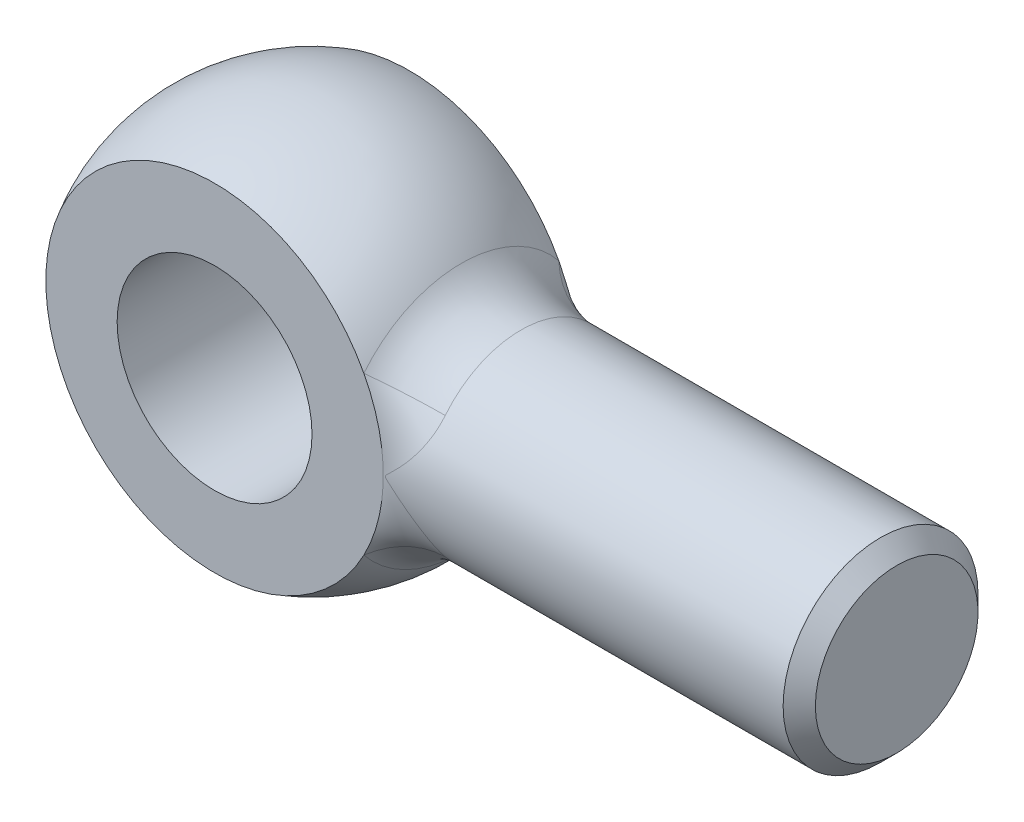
ISO-10303-21;
HEADER;
FILE_DESCRIPTION(('STEP AP214'),'2;1');
FILE_NAME('part.step','',(''),(''),'','','');
FILE_SCHEMA(('AUTOMOTIVE_DESIGN { 1 0 10303 214 1 1 1 1 }'));
ENDSEC;
DATA;
#1=APPLICATION_CONTEXT('core data for automotive mechanical design processes');
#2=APPLICATION_PROTOCOL_DEFINITION('international standard','automotive_design',2000,#1);
#3=PRODUCT_CONTEXT('',#1,'mechanical');
#4=PRODUCT('Part','Part','',(#3));
#5=PRODUCT_RELATED_PRODUCT_CATEGORY('part','',(#4));
#6=PRODUCT_DEFINITION_FORMATION('','',#4);
#7=PRODUCT_DEFINITION_CONTEXT('part definition',#1,'design');
#8=PRODUCT_DEFINITION('design','',#6,#7);
#9=PRODUCT_DEFINITION_SHAPE('','',#8);
#10=(LENGTH_UNIT() NAMED_UNIT(*) SI_UNIT(.MILLI.,.METRE.));
#11=(NAMED_UNIT(*) PLANE_ANGLE_UNIT() SI_UNIT($,.RADIAN.));
#12=(NAMED_UNIT(*) SI_UNIT($,.STERADIAN.) SOLID_ANGLE_UNIT());
#13=UNCERTAINTY_MEASURE_WITH_UNIT(LENGTH_MEASURE(1.E-05),#10,'distance_accuracy_value','');
#14=(GEOMETRIC_REPRESENTATION_CONTEXT(3) GLOBAL_UNCERTAINTY_ASSIGNED_CONTEXT((#13)) GLOBAL_UNIT_ASSIGNED_CONTEXT((#10,
#11,#12)) REPRESENTATION_CONTEXT('',''));
#15=CARTESIAN_POINT('',(0.,0.,0.));
#16=DIRECTION('',(0.,0.,1.));
#17=DIRECTION('',(1.,0.,0.));
#18=AXIS2_PLACEMENT_3D('',#15,#16,#17);
#19=CARTESIAN_POINT('',(30.,4.172,0.));
#20=DIRECTION('',(1.,0.,0.));
#21=DIRECTION('',(0.,0.,-1.));
#22=AXIS2_PLACEMENT_3D('',#19,#20,#21);
#23=PLANE('',#22);
#24=CARTESIAN_POINT('',(30.,0.,0.));
#25=DIRECTION('',(-1.,0.,0.));
#26=DIRECTION('',(0.,0.,1.));
#27=AXIS2_PLACEMENT_3D('',#24,#25,#26);
#28=CIRCLE('',#27,4.172);
#29=CARTESIAN_POINT('',(30.,0.,4.172));
#30=VERTEX_POINT('',#29);
#31=EDGE_CURVE('E117',#30,#30,#28,.T.);
#32=ORIENTED_EDGE('',*,*,#31,.F.);
#33=EDGE_LOOP('',(#32));
#34=FACE_BOUND('',#33,.T.);
#35=ADVANCED_FACE('F41',(#34),#23,.T.);
#36=CARTESIAN_POINT('',(30.,0.,0.));
#37=DIRECTION('',(-1.,0.,0.));
#38=DIRECTION('',(0.,0.,1.));
#39=AXIS2_PLACEMENT_3D('',#36,#37,#38);
#40=CONICAL_SURFACE('',#39,4.172,0.785398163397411);
#41=CARTESIAN_POINT('',(29.1719999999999,0.,0.));
#42=DIRECTION('',(-1.,0.,0.));
#43=DIRECTION('',(0.,0.,1.));
#44=AXIS2_PLACEMENT_3D('',#41,#42,#43);
#45=CIRCLE('',#44,5.);
#46=CARTESIAN_POINT('',(29.1719999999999,0.,5.));
#47=VERTEX_POINT('',#46);
#48=EDGE_CURVE('E201',#47,#47,#45,.T.);
#49=ORIENTED_EDGE('',*,*,#48,.F.);
#50=EDGE_LOOP('',(#49));
#51=FACE_BOUND('',#50,.T.);
#52=ORIENTED_EDGE('',*,*,#31,.T.);
#53=EDGE_LOOP('',(#52));
#54=FACE_BOUND('',#53,.T.);
#55=ADVANCED_FACE('F139',(#51,#54),#40,.T.);
#56=CARTESIAN_POINT('',(-31.75,0.,0.));
#57=DIRECTION('',(-1.,0.,0.));
#58=DIRECTION('',(0.,0.,1.));
#59=AXIS2_PLACEMENT_3D('',#56,#57,#58);
#60=CYLINDRICAL_SURFACE('',#59,5.);
#61=CARTESIAN_POINT('',(10.7238052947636,0.,0.));
#62=DIRECTION('',(-1.,0.,0.));
#63=DIRECTION('',(0.,0.,1.));
#64=AXIS2_PLACEMENT_3D('',#61,#62,#63);
#65=CIRCLE('',#64,5.);
#66=CARTESIAN_POINT('',(10.7238052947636,3.14149336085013,-3.88986111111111));
#67=VERTEX_POINT('',#66);
#68=CARTESIAN_POINT('',(10.7238052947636,3.14149336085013,3.88986111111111));
#69=VERTEX_POINT('',#68);
#70=EDGE_CURVE('E112',#67,#69,#65,.F.);
#71=ORIENTED_EDGE('',*,*,#70,.T.);
#72=CARTESIAN_POINT('',(-0.862857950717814,-8.61643630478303,5.00125));
#73=CARTESIAN_POINT('',(-0.861801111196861,-4.50279254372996,4.66466282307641));
#74=CARTESIAN_POINT('',(-0.895521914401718,-4.96811977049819,0.563725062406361));
#75=CARTESIAN_POINT('',(-0.747572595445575,-8.62798997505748,5.00125));
#76=CARTESIAN_POINT('',(-0.746431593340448,-4.5020088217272,4.67556750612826));
#77=CARTESIAN_POINT('',(-0.774679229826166,-4.96818118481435,0.563183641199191));
#78=CARTESIAN_POINT('',(-0.631589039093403,-8.63725756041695,5.00125));
#79=CARTESIAN_POINT('',(-0.63064115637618,-4.50135502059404,4.6843765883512));
#80=CARTESIAN_POINT('',(-0.653834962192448,-4.96822765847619,0.562773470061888));
#81=CARTESIAN_POINT('',(-0.398788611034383,-8.65112916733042,5.00125));
#82=CARTESIAN_POINT('',(-0.398129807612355,-4.50035558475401,4.69763017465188));
#83=CARTESIAN_POINT('',(-0.412144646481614,-4.96829508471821,0.562177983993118));
#84=CARTESIAN_POINT('',(-0.281971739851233,-8.65573319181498,5.00125));
#85=CARTESIAN_POINT('',(-0.281541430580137,-4.50001105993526,4.70205947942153));
#86=CARTESIAN_POINT('',(-0.291298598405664,-4.96831603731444,0.561992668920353));
#87=CARTESIAN_POINT('',(0.068905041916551,-8.66241324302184,5.00125));
#88=CARTESIAN_POINT('',(0.0689416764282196,-4.49951670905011,4.70848450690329));
#89=CARTESIAN_POINT('',(0.0712616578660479,-4.968347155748,0.561717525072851));
#90=CARTESIAN_POINT('',(0.303370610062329,-8.65735517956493,5.00125));
#91=CARTESIAN_POINT('',(0.302502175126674,-4.49990827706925,4.70358931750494));
#92=CARTESIAN_POINT('',(0.312976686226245,-4.9683255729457,0.561908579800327));
#93=CARTESIAN_POINT('',(0.770469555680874,-8.62838646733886,5.00125));
#94=CARTESIAN_POINT('',(0.769037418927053,-4.50198995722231,4.67592913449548));
#95=CARTESIAN_POINT('',(0.798135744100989,-4.96818431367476,0.563156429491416));
#96=CARTESIAN_POINT('',(1.00307769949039,-8.60434074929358,5.00125));
#97=CARTESIAN_POINT('',(1.0009155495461,-4.50367979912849,4.65316554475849));
#98=CARTESIAN_POINT('',(1.04157972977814,-4.96806393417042,0.564219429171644));
#99=CARTESIAN_POINT('',(1.46040368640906,-8.53862437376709,5.00125));
#100=CARTESIAN_POINT('',(1.45849891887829,-4.50760782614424,4.59268976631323));
#101=CARTESIAN_POINT('',(1.52843252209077,-4.96765608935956,0.567799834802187));
#102=CARTESIAN_POINT('',(1.68512169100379,-8.49695407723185,5.00125));
#103=CARTESIAN_POINT('',(1.68332822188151,-4.50983373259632,4.55521811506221));
#104=CARTESIAN_POINT('',(1.77184132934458,-4.96736862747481,0.570317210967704));
#105=CARTESIAN_POINT('',(2.13104284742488,-8.3964455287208,5.00125));
#106=CARTESIAN_POINT('',(2.13215877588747,-4.51375086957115,4.46849186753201));
#107=CARTESIAN_POINT('',(2.26740603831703,-4.96649054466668,0.577917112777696));
#108=CARTESIAN_POINT('',(2.35182046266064,-8.3370376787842,5.00125));
#109=CARTESIAN_POINT('',(2.35529889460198,-4.51542155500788,4.41910863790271));
#110=CARTESIAN_POINT('',(2.51955789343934,-4.96588927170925,0.583089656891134));
#111=CARTESIAN_POINT('',(2.77812417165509,-8.20483832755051,5.00125));
#112=CARTESIAN_POINT('',(2.79088226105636,-4.51668254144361,4.31508804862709));
#113=CARTESIAN_POINT('',(3.02354093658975,-4.96417821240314,0.597486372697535));
#114=CARTESIAN_POINT('',(2.98364840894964,-8.13204520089,5.00125));
#115=CARTESIAN_POINT('',(3.00303039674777,-4.51630055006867,4.26062998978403));
#116=CARTESIAN_POINT('',(3.27537208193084,-4.96306836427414,0.606711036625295));
#117=CARTESIAN_POINT('',(3.37698152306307,-7.9767220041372,5.00125));
#118=CARTESIAN_POINT('',(3.41571481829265,-4.51212797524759,4.15187779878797));
#119=CARTESIAN_POINT('',(3.77738251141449,-4.96005623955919,0.630866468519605));
#120=CARTESIAN_POINT('',(3.5648435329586,-7.89422293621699,5.00125));
#121=CARTESIAN_POINT('',(3.61626958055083,-4.50840115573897,4.09763132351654));
#122=CARTESIAN_POINT('',(4.02756449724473,-4.95815643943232,0.645779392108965));
#123=CARTESIAN_POINT('',(3.92270024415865,-7.72264877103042,5.00125));
#124=CARTESIAN_POINT('',(4.00657625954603,-4.49647053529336,3.99324661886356));
#125=CARTESIAN_POINT('',(4.52603392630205,-4.95315264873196,0.683111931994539));
#126=CARTESIAN_POINT('',(4.09270292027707,-7.63357663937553,5.00125));
#127=CARTESIAN_POINT('',(4.19653349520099,-4.48833493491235,3.94303459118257));
#128=CARTESIAN_POINT('',(4.77432216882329,-4.95004919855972,0.705528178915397));
#129=CARTESIAN_POINT('',(4.37658078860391,-7.47348013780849,5.00125));
#130=CARTESIAN_POINT('',(4.52233565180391,-4.46935500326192,3.8604648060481));
#131=CARTESIAN_POINT('',(5.20878020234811,-4.94298709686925,0.753197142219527));
#132=CARTESIAN_POINT('',(4.49417892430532,-7.40321146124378,5.00125));
#133=CARTESIAN_POINT('',(4.66004067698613,-4.45967495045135,3.82673663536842));
#134=CARTESIAN_POINT('',(5.3956571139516,-4.9394083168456,0.776501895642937));
#135=CARTESIAN_POINT('',(4.71944164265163,-7.2616850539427,5.00125));
#136=CARTESIAN_POINT('',(4.92926643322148,-4.43708110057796,3.76391980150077));
#137=CARTESIAN_POINT('',(5.76658823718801,-4.93083226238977,0.829222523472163));
#138=CARTESIAN_POINT('',(4.82710313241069,-7.19042702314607,5.00125));
#139=CARTESIAN_POINT('',(5.06096003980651,-4.42418894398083,3.73476001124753));
#140=CARTESIAN_POINT('',(5.95064155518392,-4.92583454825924,0.858640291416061));
#141=CARTESIAN_POINT('',(5.03228742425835,-7.04833739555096,5.00125));
#142=CARTESIAN_POINT('',(5.31711450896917,-4.39519692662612,3.68157412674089));
#143=CARTESIAN_POINT('',(6.31352343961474,-4.91399815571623,0.92396802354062));
#144=CARTESIAN_POINT('',(5.1298700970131,-6.97750595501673,5.00125));
#145=CARTESIAN_POINT('',(5.44179076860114,-4.37913336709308,3.65744857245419));
#146=CARTESIAN_POINT('',(6.49237770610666,-4.90717133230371,0.959835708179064));
#147=CARTESIAN_POINT('',(5.31631273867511,-6.8365180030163,5.00125));
#148=CARTESIAN_POINT('',(5.68453207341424,-4.34384287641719,3.61405245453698));
#149=CARTESIAN_POINT('',(6.84467398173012,-4.89111014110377,1.03858370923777));
#150=CARTESIAN_POINT('',(5.40517329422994,-6.76636144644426,5.00125));
#151=CARTESIAN_POINT('',(5.80277503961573,-4.32462225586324,3.59472142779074));
#152=CARTESIAN_POINT('',(7.01811635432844,-4.88187593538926,1.0814635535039));
#153=CARTESIAN_POINT('',(5.57612220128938,-6.62621654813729,5.00125));
#154=CARTESIAN_POINT('',(6.03397879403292,-4.28300096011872,3.56035343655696));
#155=CARTESIAN_POINT('',(7.36038981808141,-4.86020815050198,1.17503773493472));
#156=CARTESIAN_POINT('',(5.65810088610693,-6.55624372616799,5.00125));
#157=CARTESIAN_POINT('',(6.14702245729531,-4.26055664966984,3.54532854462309));
#158=CARTESIAN_POINT('',(7.529124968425,-4.84773240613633,1.22583123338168));
#159=CARTESIAN_POINT('',(5.81481016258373,-6.41766493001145,5.00125));
#160=CARTESIAN_POINT('',(6.36592319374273,-4.21315274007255,3.51941155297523));
#161=CARTESIAN_POINT('',(7.85775929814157,-4.81890417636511,1.33466426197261));
#162=CARTESIAN_POINT('',(5.88954060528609,-6.34905898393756,5.00125));
#163=CARTESIAN_POINT('',(6.47192091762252,-4.18818582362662,3.5084841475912));
#164=CARTESIAN_POINT('',(8.01765829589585,-4.80255161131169,1.39270394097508));
#165=CARTESIAN_POINT('',(6.03278406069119,-6.21311313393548,5.00125));
#166=CARTESIAN_POINT('',(6.67686749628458,-4.13633281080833,3.49020297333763));
#167=CARTESIAN_POINT('',(8.32707718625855,-4.76518445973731,1.5156334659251));
#168=CARTESIAN_POINT('',(6.10129103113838,-6.14577450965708,5.00125));
#169=CARTESIAN_POINT('',(6.77591747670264,-4.10943559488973,3.48282867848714));
#170=CARTESIAN_POINT('',(8.47658695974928,-4.74416540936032,1.58052983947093));
#171=CARTESIAN_POINT('',(6.23297871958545,-6.01217694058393,5.00125));
#172=CARTESIAN_POINT('',(6.96712156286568,-4.05444844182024,3.47125199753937));
#173=CARTESIAN_POINT('',(8.76347672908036,-4.69673297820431,1.71635317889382));
#174=CARTESIAN_POINT('',(6.29615999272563,-5.94591788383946,5.00125));
#175=CARTESIAN_POINT('',(7.05934857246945,-4.02635137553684,3.46703319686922));
#176=CARTESIAN_POINT('',(8.90085798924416,-4.67032016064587,1.78727951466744));
#177=CARTESIAN_POINT('',(6.41273110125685,-5.81988617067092,5.00125));
#178=CARTESIAN_POINT('',(7.22952707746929,-3.97212801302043,3.46187150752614));
#179=CARTESIAN_POINT('',(9.15055888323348,-4.61405816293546,1.92760522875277));
#180=CARTESIAN_POINT('',(6.46649249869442,-5.76005890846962,5.00125));
#181=CARTESIAN_POINT('',(7.30802376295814,-3.94605430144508,3.46066251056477));
#182=CARTESIAN_POINT('',(9.26402053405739,-4.58472071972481,1.9965832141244));
#183=CARTESIAN_POINT('',(6.57102889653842,-5.64051255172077,5.00125));
#184=CARTESIAN_POINT('',(7.46014141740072,-3.89382172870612,3.46092508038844));
#185=CARTESIAN_POINT('',(9.47892156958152,-4.52063350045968,2.13772743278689));
#186=CARTESIAN_POINT('',(6.62180415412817,-5.58079344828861,5.00125));
#187=CARTESIAN_POINT('',(7.53377357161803,-3.86766539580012,3.46238693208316));
#188=CARTESIAN_POINT('',(9.58036199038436,-4.48588419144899,2.20989339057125));
#189=CARTESIAN_POINT('',(6.72095204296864,-5.46098407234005,5.00125));
#190=CARTESIAN_POINT('',(7.67661049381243,-3.81540230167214,3.46838939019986));
#191=CARTESIAN_POINT('',(9.77059775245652,-4.4107031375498,2.35636699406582));
#192=CARTESIAN_POINT('',(6.76932506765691,-5.40089386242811,5.00125));
#193=CARTESIAN_POINT('',(7.74581201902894,-3.78930279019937,3.47291725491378));
#194=CARTESIAN_POINT('',(9.85939516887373,-4.37027232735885,2.43067428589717));
#195=CARTESIAN_POINT('',(6.86415368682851,-5.27984819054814,5.00125));
#196=CARTESIAN_POINT('',(7.88012954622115,-3.7369748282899,3.485612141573));
#197=CARTESIAN_POINT('',(10.0239492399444,-4.2836236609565,2.5803220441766));
#198=CARTESIAN_POINT('',(6.91060945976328,-5.21889280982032,5.00125));
#199=CARTESIAN_POINT('',(7.94523260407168,-3.71075852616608,3.49376131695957));
#200=CARTESIAN_POINT('',(10.0997071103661,-4.23740634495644,2.65566241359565));
#201=CARTESIAN_POINT('',(7.03834900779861,-5.04659830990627,5.00125));
#202=CARTESIAN_POINT('',(8.12148508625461,-3.6368083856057,3.52247196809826));
#203=CARTESIAN_POINT('',(10.2929023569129,-4.10014537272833,2.86613289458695));
#204=CARTESIAN_POINT('',(7.1180384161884,-4.93363578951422,5.00125));
#205=CARTESIAN_POINT('',(8.22869462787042,-3.58833918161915,3.54772900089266));
#206=CARTESIAN_POINT('',(10.3957527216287,-4.0026176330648,3.00129962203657));
#207=CARTESIAN_POINT('',(7.27413614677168,-4.70043423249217,5.00125));
#208=CARTESIAN_POINT('',(8.43022730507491,-3.48427178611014,3.61491786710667));
#209=CARTESIAN_POINT('',(10.5591168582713,-3.79022376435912,3.26540788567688));
#210=CARTESIAN_POINT('',(7.35054861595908,-4.58020488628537,5.00125));
#211=CARTESIAN_POINT('',(8.52448093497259,-3.42886340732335,3.65659233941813));
#212=CARTESIAN_POINT('',(10.6196857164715,-3.67538043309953,3.3943573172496));
#213=CARTESIAN_POINT('',(7.46541145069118,-4.38874546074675,5.00125));
#214=CARTESIAN_POINT('',(8.65724483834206,-3.33324264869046,3.7330010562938));
#215=CARTESIAN_POINT('',(10.6817606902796,-3.48840706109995,3.58323032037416));
#216=CARTESIAN_POINT('',(7.50482103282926,-4.32105092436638,5.00125));
#217=CARTESIAN_POINT('',(8.70094036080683,-3.29833012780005,3.76161657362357));
#218=CARTESIAN_POINT('',(10.6976468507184,-3.42157732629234,3.64710578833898));
#219=CARTESIAN_POINT('',(7.58289728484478,-4.18252183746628,5.00125));
#220=CARTESIAN_POINT('',(8.78351629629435,-3.22373634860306,3.82286084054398));
#221=CARTESIAN_POINT('',(10.7186694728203,-3.2842155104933,3.77127290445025));
#222=CARTESIAN_POINT('',(7.62156418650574,-4.11168829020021,5.00125));
#223=CARTESIAN_POINT('',(8.82241247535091,-3.1841038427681,3.85544888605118));
#224=CARTESIAN_POINT('',(10.7238093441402,-3.21368461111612,3.83156568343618));
#225=CARTESIAN_POINT('',(7.73750643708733,-3.89181703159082,5.00125));
#226=CARTESIAN_POINT('',(8.9317915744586,-3.05600362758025,3.95890261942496));
#227=CARTESIAN_POINT('',(10.7237970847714,-2.99512772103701,4.00805337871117));
#228=CARTESIAN_POINT('',(7.81363034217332,-3.73720552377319,5.00125));
#229=CARTESIAN_POINT('',(8.99461237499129,-2.95860170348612,4.03522689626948));
#230=CARTESIAN_POINT('',(10.7026440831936,-2.84193698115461,4.11803525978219));
#231=CARTESIAN_POINT('',(7.96156931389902,-3.41073612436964,5.00125));
#232=CARTESIAN_POINT('',(9.09454908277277,-2.73636998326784,4.19370405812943));
#233=CARTESIAN_POINT('',(10.6224425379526,-2.52621041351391,4.31896623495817));
#234=CARTESIAN_POINT('',(8.03337474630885,-3.23884180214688,5.00125));
#235=CARTESIAN_POINT('',(9.13197126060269,-2.61189686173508,4.27577104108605));
#236=CARTESIAN_POINT('',(10.5633124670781,-2.36365516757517,4.40987382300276));
#237=CARTESIAN_POINT('',(8.17457989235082,-2.86462727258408,5.00125));
#238=CARTESIAN_POINT('',(9.18005137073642,-2.32723829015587,4.44082582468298));
#239=CARTESIAN_POINT('',(10.4070580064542,-2.02348755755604,4.57639872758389));
#240=CARTESIAN_POINT('',(8.243576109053,-2.66109975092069,5.00125));
#241=CARTESIAN_POINT('',(9.18945943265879,-2.16552905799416,4.52378782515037));
#242=CARTESIAN_POINT('',(10.3078649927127,-1.84555722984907,4.65076980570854));
#243=CARTESIAN_POINT('',(8.33871317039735,-2.33793492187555,5.00125));
#244=CARTESIAN_POINT('',(9.1795258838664,-1.90203853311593,4.63765368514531));
#245=CARTESIAN_POINT('',(10.1348873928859,-1.57787000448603,4.74545355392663));
#246=CARTESIAN_POINT('',(8.36903257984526,-2.22723469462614,5.00125));
#247=CARTESIAN_POINT('',(9.17229866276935,-1.81113467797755,4.67373124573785));
#248=CARTESIAN_POINT('',(10.0731970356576,-1.48850920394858,4.77420260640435));
#249=CARTESIAN_POINT('',(8.42634247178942,-1.99950998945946,5.00125));
#250=CARTESIAN_POINT('',(9.15004723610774,-1.62324689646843,4.74131895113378));
#251=CARTESIAN_POINT('',(9.94228075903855,-1.30989062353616,4.82626396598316));
#252=CARTESIAN_POINT('',(8.45333315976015,-1.88248590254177,5.00125));
#253=CARTESIAN_POINT('',(9.13506005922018,-1.52623160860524,4.77287926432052));
#254=CARTESIAN_POINT('',(9.8730553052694,-1.2206328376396,4.84957660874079));
#255=CARTESIAN_POINT('',(8.49871192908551,-1.66415731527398,5.00125));
#256=CARTESIAN_POINT('',(9.10094624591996,-1.34519675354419,4.8252499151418));
#257=CARTESIAN_POINT('',(9.74109490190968,-1.05913014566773,4.88710473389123));
#258=CARTESIAN_POINT('',(8.51776780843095,-1.5639484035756,5.00125));
#259=CARTESIAN_POINT('',(9.08312340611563,-1.26212400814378,4.8469804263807));
#260=CARTESIAN_POINT('',(9.67952745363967,-0.9867918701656,4.90220529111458));
#261=CARTESIAN_POINT('',(8.55285045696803,-1.35906131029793,5.00125));
#262=CARTESIAN_POINT('',(9.04259103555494,-1.09279001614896,4.88645553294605));
#263=CARTESIAN_POINT('',(9.55208154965,-0.842673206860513,4.92902339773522));
#264=CARTESIAN_POINT('',(8.5688775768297,-1.25438364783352,5.00125));
#265=CARTESIAN_POINT('',(9.01988573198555,-1.00648646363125,4.90422645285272));
#266=CARTESIAN_POINT('',(9.4862035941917,-0.770892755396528,4.94074133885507));
#267=CARTESIAN_POINT('',(8.59747505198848,-1.0404651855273,5.00125));
#268=CARTESIAN_POINT('',(8.96979077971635,-0.831078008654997,4.93545801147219));
#269=CARTESIAN_POINT('',(9.35050537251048,-0.628077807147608,4.96091919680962));
#270=CARTESIAN_POINT('',(8.61004719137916,-0.931226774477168,5.00125));
#271=CARTESIAN_POINT('',(8.94239874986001,-0.741921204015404,4.94894329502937));
#272=CARTESIAN_POINT('',(9.28068716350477,-0.557042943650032,4.9693807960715));
#273=CARTESIAN_POINT('',(8.62597423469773,-0.763681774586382,5.00125));
#274=CARTESIAN_POINT('',(8.89805762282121,-0.606131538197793,4.96576480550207));
#275=CARTESIAN_POINT('',(9.17349276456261,-0.451046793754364,4.9797406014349));
#276=CARTESIAN_POINT('',(8.63079472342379,-0.707218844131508,5.00125));
#277=CARTESIAN_POINT('',(8.88274334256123,-0.560547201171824,4.97080347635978));
#278=CARTESIAN_POINT('',(9.13735009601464,-0.415807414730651,4.98280510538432));
#279=CARTESIAN_POINT('',(8.63939754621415,-0.592955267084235,5.00125));
#280=CARTESIAN_POINT('',(8.85113497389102,-0.468672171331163,4.97971919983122));
#281=CARTESIAN_POINT('',(9.06442721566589,-0.34547471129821,4.98817526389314));
#282=CARTESIAN_POINT('',(8.64317990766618,-0.53515465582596,5.00125));
#283=CARTESIAN_POINT('',(8.83483855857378,-0.422372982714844,4.98359807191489));
#284=CARTESIAN_POINT('',(9.02764702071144,-0.310381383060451,4.99048093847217));
#285=CARTESIAN_POINT('',(8.64839006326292,-0.440612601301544,5.00125));
#286=CARTESIAN_POINT('',(8.80799762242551,-0.346971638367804,4.988896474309));
#287=CARTESIAN_POINT('',(8.96827630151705,-0.253781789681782,4.99360169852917));
#288=CARTESIAN_POINT('',(8.65016234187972,-0.404388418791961,5.00125));
#289=CARTESIAN_POINT('',(8.79767177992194,-0.318159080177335,4.99068664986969));
#290=CARTESIAN_POINT('',(8.94570919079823,-0.232279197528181,4.99464819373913));
#291=CARTESIAN_POINT('',(8.65327697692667,-0.331126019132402,5.00125));
#292=CARTESIAN_POINT('',(8.77692436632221,-0.260051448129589,4.99381582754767));
#293=CARTESIAN_POINT('',(8.90087475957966,-0.189166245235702,4.99646704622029));
#294=CARTESIAN_POINT('',(8.65461943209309,-0.294087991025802,5.00125));
#295=CARTESIAN_POINT('',(8.76650203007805,-0.230754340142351,4.9951551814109));
#296=CARTESIAN_POINT('',(8.87860737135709,-0.167555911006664,4.99723946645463));
#297=CARTESIAN_POINT('',(8.65648023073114,-0.231252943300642,5.00125));
#298=CARTESIAN_POINT('',(8.74953266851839,-0.181197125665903,4.99700224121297));
#299=CARTESIAN_POINT('',(8.84271136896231,-0.131213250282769,4.99829907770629));
#300=CARTESIAN_POINT('',(8.65712399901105,-0.205845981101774,5.00125));
#301=CARTESIAN_POINT('',(8.74285691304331,-0.161197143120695,4.99763827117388));
#302=CARTESIAN_POINT('',(8.82868735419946,-0.116601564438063,4.99866213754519));
#303=CARTESIAN_POINT('',(8.65820478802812,-0.153852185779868,5.00125));
#304=CARTESIAN_POINT('',(8.73014782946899,-0.120349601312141,4.99870251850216));
#305=CARTESIAN_POINT('',(8.80214499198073,-0.0868719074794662,4.99926757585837));
#306=CARTESIAN_POINT('',(8.65864132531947,-0.127262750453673,5.00125));
#307=CARTESIAN_POINT('',(8.72411572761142,-0.0994994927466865,4.99913028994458));
#308=CARTESIAN_POINT('',(8.78963021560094,-0.0717528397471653,4.99950967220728));
#309=CARTESIAN_POINT('',(8.65913297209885,-0.0845075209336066,5.00125));
#310=CARTESIAN_POINT('',(8.71653200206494,-0.0660323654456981,4.99961089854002));
#311=CARTESIAN_POINT('',(8.77395674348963,-0.0475654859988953,4.99978101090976));
#312=CARTESIAN_POINT('',(8.65927129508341,-0.0690682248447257,5.00125));
#313=CARTESIAN_POINT('',(8.71418796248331,-0.0539582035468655,4.99974580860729));
#314=CARTESIAN_POINT('',(8.76912673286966,-0.0388542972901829,4.99985699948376));
#315=CARTESIAN_POINT('',(8.65946427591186,-0.037665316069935,5.00125));
#316=CARTESIAN_POINT('',(8.71080413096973,-0.0294162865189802,4.99993388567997));
#317=CARTESIAN_POINT('',(8.76216116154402,-0.0211698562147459,4.99996285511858));
#318=CARTESIAN_POINT('',(8.65951986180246,-0.0217096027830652,5.00125));
#319=CARTESIAN_POINT('',(8.70974985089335,-0.0169543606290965,4.99998796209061));
#320=CARTESIAN_POINT('',(8.75999576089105,-0.0122006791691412,4.99999323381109));
#321=CARTESIAN_POINT('',(8.65954094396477,0.0104595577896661,5.00125));
#322=CARTESIAN_POINT('',(8.70935936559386,0.00816859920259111,5.00000848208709));
#323=CARTESIAN_POINT('',(8.75919320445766,0.00587843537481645,5.00000476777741));
#324=CARTESIAN_POINT('',(8.6595055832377,0.0266740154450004,5.00125));
#325=CARTESIAN_POINT('',(8.71003949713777,0.0208306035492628,4.99997409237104));
#326=CARTESIAN_POINT('',(8.76058961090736,0.0149889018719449,4.99998545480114));
#327=CARTESIAN_POINT('',(8.65934870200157,0.0586494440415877,5.00125));
#328=CARTESIAN_POINT('',(8.71284636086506,0.0458136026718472,4.99982126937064));
#329=CARTESIAN_POINT('',(8.76636412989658,0.0329825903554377,4.9998994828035));
#330=CARTESIAN_POINT('',(8.65922618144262,0.0744029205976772,5.00125));
#331=CARTESIAN_POINT('',(8.71498991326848,0.0581290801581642,4.99970185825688));
#332=CARTESIAN_POINT('',(8.77077682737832,0.0418619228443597,4.99983227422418));
#333=CARTESIAN_POINT('',(8.65878402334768,0.117064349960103,5.00125));
#334=CARTESIAN_POINT('',(8.72202090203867,0.0915099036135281,4.99926995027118));
#335=CARTESIAN_POINT('',(8.7852934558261,0.0659694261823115,4.99958861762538));
#336=CARTESIAN_POINT('',(8.65838527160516,0.143255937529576,5.00125));
#337=CARTESIAN_POINT('',(8.72775180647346,0.112038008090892,4.99887959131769));
#338=CARTESIAN_POINT('',(8.79716626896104,0.0808411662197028,4.99936791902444));
#339=CARTESIAN_POINT('',(8.65738440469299,0.194552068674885,5.00125));
#340=CARTESIAN_POINT('',(8.73997899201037,0.152315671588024,4.99789511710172));
#341=CARTESIAN_POINT('',(8.82266007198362,0.11012536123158,4.99880850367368));
#342=CARTESIAN_POINT('',(8.65678154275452,0.219652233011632,5.00125));
#343=CARTESIAN_POINT('',(8.74647831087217,0.172062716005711,4.9973002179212));
#344=CARTESIAN_POINT('',(8.83628736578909,0.12453591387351,4.99846935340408));
#345=CARTESIAN_POINT('',(8.65537885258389,0.269322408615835,5.00125));
#346=CARTESIAN_POINT('',(8.75976314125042,0.211211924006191,4.99590970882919));
#347=CARTESIAN_POINT('',(8.86433046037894,0.153212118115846,4.99767270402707));
#348=CARTESIAN_POINT('',(8.65457807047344,0.293889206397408,5.00125));
#349=CARTESIAN_POINT('',(8.76655016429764,0.230612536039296,4.99511307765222));
#350=CARTESIAN_POINT('',(8.87874980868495,0.167476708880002,4.99721463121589));
#351=CARTESIAN_POINT('',(8.65278925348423,0.342530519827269,5.00125));
#352=CARTESIAN_POINT('',(8.78015032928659,0.269095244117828,4.99332562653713));
#353=CARTESIAN_POINT('',(8.90785204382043,0.195879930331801,4.9961817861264));
#354=CARTESIAN_POINT('',(8.65180157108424,0.366605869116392,5.00125));
#355=CARTESIAN_POINT('',(8.7869636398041,0.288178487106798,4.99233511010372));
#356=CARTESIAN_POINT('',(8.92253438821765,0.210018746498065,4.99560723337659));
#357=CARTESIAN_POINT('',(8.6485880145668,0.437796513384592,5.00125));
#358=CARTESIAN_POINT('',(8.8071649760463,0.34471294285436,4.98909807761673));
#359=CARTESIAN_POINT('',(8.96639267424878,0.252062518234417,4.99372069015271));
#360=CARTESIAN_POINT('',(8.64609547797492,0.484431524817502,5.00125));
#361=CARTESIAN_POINT('',(8.82046777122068,0.3818794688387,4.9865703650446));
#362=CARTESIAN_POINT('',(8.9957084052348,0.279915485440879,4.99223680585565));
#363=CARTESIAN_POINT('',(8.64042791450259,0.576748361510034,5.00125));
#364=CARTESIAN_POINT('',(8.84654956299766,0.455691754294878,4.98077317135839));
#365=CARTESIAN_POINT('',(9.05412735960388,0.335661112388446,4.98879848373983));
#366=CARTESIAN_POINT('',(8.63725287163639,0.62243016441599,5.00125));
#367=CARTESIAN_POINT('',(8.85932994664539,0.492341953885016,4.9775029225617));
#368=CARTESIAN_POINT('',(9.08323057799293,0.363553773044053,4.98684403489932));
#369=CARTESIAN_POINT('',(8.62674732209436,0.758281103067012,5.00125));
#370=CARTESIAN_POINT('',(8.89675873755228,0.601697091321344,4.96659018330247));
#371=CARTESIAN_POINT('',(9.16995701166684,0.447411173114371,4.98025809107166));
#372=CARTESIAN_POINT('',(8.6184391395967,0.847197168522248,5.00125));
#373=CARTESIAN_POINT('',(8.92046053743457,0.673715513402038,4.95784973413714));
#374=CARTESIAN_POINT('',(9.22695989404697,0.503520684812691,4.97490553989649));
#375=CARTESIAN_POINT('',(8.59948200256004,1.021809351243,5.00125));
#376=CARTESIAN_POINT('',(8.96496192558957,0.815821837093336,4.93759329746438));
#377=CARTESIAN_POINT('',(9.33854131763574,0.616082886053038,4.96222120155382));
#378=CARTESIAN_POINT('',(8.58883871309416,1.10751268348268,5.00125));
#379=CARTESIAN_POINT('',(8.9857737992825,0.885944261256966,4.92607434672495));
#380=CARTESIAN_POINT('',(9.393125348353,0.672534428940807,4.95489419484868));
#381=CARTESIAN_POINT('',(8.56542374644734,1.27602947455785,5.00125));
#382=CARTESIAN_POINT('',(9.02443688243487,1.02431361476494,4.9003904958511));
#383=CARTESIAN_POINT('',(9.49978000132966,0.785866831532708,4.9381875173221));
#384=CARTESIAN_POINT('',(8.55265191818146,1.35884272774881,5.00125));
#385=CARTESIAN_POINT('',(9.04228970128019,1.09258627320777,4.88621396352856));
#386=CARTESIAN_POINT('',(9.55185044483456,0.842747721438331,4.92880770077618));
#387=CARTESIAN_POINT('',(8.51210420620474,1.59924693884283,5.00125));
#388=CARTESIAN_POINT('',(9.09054958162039,1.29144328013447,4.84061279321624));
#389=CARTESIAN_POINT('',(9.70163725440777,1.01125330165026,4.89797859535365));
#390=CARTESIAN_POINT('',(8.48162736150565,1.75290341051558,5.00125));
#391=CARTESIAN_POINT('',(9.11658162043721,1.41904962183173,4.80566256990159));
#392=CARTESIAN_POINT('',(9.79557243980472,1.12339821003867,4.87354494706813));
#393=CARTESIAN_POINT('',(8.41476470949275,2.0499808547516,5.00125));
#394=CARTESIAN_POINT('',(9.15650215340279,1.66511331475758,4.72777691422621));
#395=CARTESIAN_POINT('',(9.97203697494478,1.34833035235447,4.81616907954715));
#396=CARTESIAN_POINT('',(8.37837685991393,2.19339826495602,5.00125));
#397=CARTESIAN_POINT('',(9.17033098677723,1.78366327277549,4.68473592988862));
#398=CARTESIAN_POINT('',(10.0545623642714,1.46111779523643,4.7832239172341));
#399=CARTESIAN_POINT('',(8.30088446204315,2.47053092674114,5.00125));
#400=CARTESIAN_POINT('',(9.18558108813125,2.01038390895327,4.59253980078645));
#401=CARTESIAN_POINT('',(10.2070762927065,1.68646524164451,4.7084946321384));
#402=CARTESIAN_POINT('',(8.25977817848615,2.60424257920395,5.00125));
#403=CARTESIAN_POINT('',(9.18690744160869,2.11858101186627,4.54328856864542));
#404=CARTESIAN_POINT('',(10.2770601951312,1.7990251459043,4.66670725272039));
#405=CARTESIAN_POINT('',(8.17390012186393,2.86240276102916,5.00125));
#406=CARTESIAN_POINT('',(9.17713090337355,2.32350993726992,4.44097547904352));
#407=CARTESIAN_POINT('',(10.4031917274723,2.02278789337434,4.57416635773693));
#408=CARTESIAN_POINT('',(8.12912955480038,2.98685431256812,5.00125));
#409=CARTESIAN_POINT('',(9.16591899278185,2.42021479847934,4.3878460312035));
#410=CARTESIAN_POINT('',(10.4593438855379,2.13399116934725,4.52341578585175));
#411=CARTESIAN_POINT('',(8.01096660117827,3.29426685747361,5.00125));
#412=CARTESIAN_POINT('',(9.12152753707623,2.65277847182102,4.24996109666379));
#413=CARTESIAN_POINT('',(10.583679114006,2.41538221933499,4.38208020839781));
#414=CARTESIAN_POINT('',(7.93552862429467,3.47118123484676,5.00125));
#415=CARTESIAN_POINT('',(9.07938614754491,2.77921882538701,4.16454506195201));
#416=CARTESIAN_POINT('',(10.6411262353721,2.58390307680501,4.28505803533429));
#417=CARTESIAN_POINT('',(7.78010776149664,3.80678322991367,5.00125));
#418=CARTESIAN_POINT('',(8.96823706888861,3.00355146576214,4.00104184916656));
#419=CARTESIAN_POINT('',(10.7141025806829,2.91036294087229,4.07036182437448));
#420=CARTESIAN_POINT('',(7.70012728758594,3.96548038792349,5.00125));
#421=CARTESIAN_POINT('',(8.89885322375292,3.10097136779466,3.923098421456));
#422=CARTESIAN_POINT('',(10.7296538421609,3.0683074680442,3.9526986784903));
#423=CARTESIAN_POINT('',(7.57751800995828,4.19239130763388,5.00125));
#424=CARTESIAN_POINT('',(8.77811840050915,3.22934720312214,3.81835702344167));
#425=CARTESIAN_POINT('',(10.7178736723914,3.29396950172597,3.76292126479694));
#426=CARTESIAN_POINT('',(7.53607459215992,4.26638643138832,5.00125));
#427=CARTESIAN_POINT('',(8.73467901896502,3.26941645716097,3.7852658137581));
#428=CARTESIAN_POINT('',(10.7080092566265,3.36752677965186,3.69722165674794));
#429=CARTESIAN_POINT('',(7.45238111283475,4.41095125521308,5.00125));
#430=CARTESIAN_POINT('',(8.64264366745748,3.34466476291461,3.72381747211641));
#431=CARTESIAN_POINT('',(10.6759027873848,3.5101896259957,3.56204945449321));
#432=CARTESIAN_POINT('',(7.41013141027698,4.48152243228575,5.00125));
#433=CARTESIAN_POINT('',(8.59403809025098,3.37979249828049,3.69550705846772));
#434=CARTESIAN_POINT('',(10.6536661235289,3.57929711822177,3.49257851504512));
#435=CARTESIAN_POINT('',(7.32479881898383,4.6196766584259,5.00125));
#436=CARTESIAN_POINT('',(8.49221223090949,3.44628340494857,3.64403307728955));
#437=CARTESIAN_POINT('',(10.596344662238,3.71254372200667,3.3505974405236));
#438=CARTESIAN_POINT('',(7.28171605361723,4.68726014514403,5.00125));
#439=CARTESIAN_POINT('',(8.43899420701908,3.47760252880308,3.62091763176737));
#440=CARTESIAN_POINT('',(10.5612617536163,3.77668356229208,3.27808775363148));
#441=CARTESIAN_POINT('',(7.19458901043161,4.81992584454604,5.00125));
#442=CARTESIAN_POINT('',(8.32835186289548,3.53765860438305,3.57985582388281));
#443=CARTESIAN_POINT('',(10.4778936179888,3.89958320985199,3.13088474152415));
#444=CARTESIAN_POINT('',(7.150544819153,4.88500828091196,5.00125));
#445=CARTESIAN_POINT('',(8.27093965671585,3.56636098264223,3.56195268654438));
#446=CARTESIAN_POINT('',(10.4296095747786,3.95834349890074,3.05619161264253));
#447=CARTESIAN_POINT('',(7.0653044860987,5.00739647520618,5.00125));
#448=CARTESIAN_POINT('',(8.15752277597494,3.61971598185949,3.53242464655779));
#449=CARTESIAN_POINT('',(10.3245899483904,4.06513204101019,2.91238533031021));
#450=CARTESIAN_POINT('',(7.02420891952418,5.06487485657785,5.00125));
#451=CARTESIAN_POINT('',(8.10184660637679,3.64449126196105,3.52040152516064));
#452=CARTESIAN_POINT('',(10.2690065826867,4.11365022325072,2.84337521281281));
#453=CARTESIAN_POINT('',(6.94080060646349,5.17858660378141,5.00125));
#454=CARTESIAN_POINT('',(7.98721103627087,3.69343432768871,3.50000220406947));
#455=CARTESIAN_POINT('',(10.1466905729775,4.20584949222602,2.70513129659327));
#456=CARTESIAN_POINT('',(6.89848744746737,5.23481953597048,5.00125));
#457=CARTESIAN_POINT('',(7.92826486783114,3.71758718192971,3.49164790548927));
#458=CARTESIAN_POINT('',(10.0799541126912,4.2495289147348,2.63589742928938));
#459=CARTESIAN_POINT('',(6.81238652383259,5.34638685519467,5.00125));
#460=CARTESIAN_POINT('',(7.80702433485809,3.76570314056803,3.47812793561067));
#461=CARTESIAN_POINT('',(9.93548787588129,4.33196159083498,2.49810887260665));
#462=CARTESIAN_POINT('',(6.76859971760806,5.40172179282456,5.00125));
#463=CARTESIAN_POINT('',(7.74474378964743,3.78965589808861,3.47297521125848));
#464=CARTESIAN_POINT('',(9.85776514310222,4.37071797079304,2.42955377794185));
#465=CARTESIAN_POINT('',(6.67916074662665,5.51192710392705,5.00125));
#466=CARTESIAN_POINT('',(7.61657020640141,3.83758425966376,3.46540202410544));
#467=CARTESIAN_POINT('',(9.69156148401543,4.44340917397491,2.29391557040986));
#468=CARTESIAN_POINT('',(6.63350790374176,5.56679729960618,5.00125));
#469=CARTESIAN_POINT('',(7.55068210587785,3.8615528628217,3.46299328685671));
#470=CARTESIAN_POINT('',(9.60307662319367,4.47734222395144,2.22683300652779));
#471=CARTESIAN_POINT('',(6.49624133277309,5.72763812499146,5.00125));
#472=CARTESIAN_POINT('',(7.3513179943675,3.93202215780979,3.45935471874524));
#473=CARTESIAN_POINT('',(9.32826420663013,4.57000556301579,2.0334590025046));
#474=CARTESIAN_POINT('',(6.40144578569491,5.83357465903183,5.00125));
#475=CARTESIAN_POINT('',(7.21265465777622,3.97847632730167,3.46136956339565));
#476=CARTESIAN_POINT('',(9.12760488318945,4.62237322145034,1.91025201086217));
#477=CARTESIAN_POINT('',(6.19974350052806,6.04750367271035,5.00125));
#478=CARTESIAN_POINT('',(6.91842760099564,4.06952913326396,3.47313155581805));
#479=CARTESIAN_POINT('',(8.69206490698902,4.71170574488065,1.67791881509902));
#480=CARTESIAN_POINT('',(6.0928350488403,6.15549644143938,5.00125));
#481=CARTESIAN_POINT('',(6.76265463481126,4.11414524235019,3.48293415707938));
#482=CARTESIAN_POINT('',(8.45717941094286,4.74866842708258,1.56879460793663));
#483=CARTESIAN_POINT('',(5.85748684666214,6.38004717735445,5.00125));
#484=CARTESIAN_POINT('',(6.42536886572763,4.20040428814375,3.51228761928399));
#485=CARTESIAN_POINT('',(7.9480705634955,4.81168608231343,1.36372092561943));
#486=CARTESIAN_POINT('',(5.72828684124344,6.49677108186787,5.00125));
#487=CARTESIAN_POINT('',(6.24256614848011,4.24184644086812,3.53236768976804));
#488=CARTESIAN_POINT('',(7.67254070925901,4.83716592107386,1.26860055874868));
#489=CARTESIAN_POINT('',(5.44759750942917,6.73386015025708,5.00125));
#490=CARTESIAN_POINT('',(5.85787006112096,4.31648208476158,3.58505468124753));
#491=CARTESIAN_POINT('',(7.09947739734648,4.87835278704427,1.09966804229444));
#492=CARTESIAN_POINT('',(5.29612643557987,6.85422226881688,5.00125));
#493=CARTESIAN_POINT('',(5.65521451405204,4.34970340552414,3.61786553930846));
#494=CARTESIAN_POINT('',(6.80196205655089,4.89406776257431,1.02583858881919));
#495=CARTESIAN_POINT('',(4.99218230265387,7.07781634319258,5.00125));
#496=CARTESIAN_POINT('',(5.26511588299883,4.40226380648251,3.69131249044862));
#497=CARTESIAN_POINT('',(6.23933958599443,4.91710515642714,0.90832707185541));
#498=CARTESIAN_POINT('',(4.84341952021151,7.1808469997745,5.00125));
#499=CARTESIAN_POINT('',(5.07914567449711,4.42296876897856,3.73025807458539));
#500=CARTESIAN_POINT('',(5.97625239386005,4.92534460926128,0.861758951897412));
#501=CARTESIAN_POINT('',(4.52522389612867,7.38550169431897,5.00125));
#502=CARTESIAN_POINT('',(4.69500191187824,4.45769450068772,3.81776482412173));
#503=CARTESIAN_POINT('',(5.44341476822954,4.93869786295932,0.781611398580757));
#504=CARTESIAN_POINT('',(4.35577705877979,7.48712472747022,5.00125));
#505=CARTESIAN_POINT('',(4.49628470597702,4.47164727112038,3.86655265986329));
#506=CARTESIAN_POINT('',(5.1736599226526,4.9438095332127,0.74804082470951));
#507=CARTESIAN_POINT('',(3.99371085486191,7.68640645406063,5.00125));
#508=CARTESIAN_POINT('',(4.08490123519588,4.49359689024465,3.97215305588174));
#509=CARTESIAN_POINT('',(4.62797081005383,4.95203035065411,0.691526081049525));
#510=CARTESIAN_POINT('',(3.80088878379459,7.78401894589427,5.00125));
#511=CARTESIAN_POINT('',(3.87171745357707,4.50144674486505,4.02921427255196));
#512=CARTESIAN_POINT('',(4.35200230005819,4.95512023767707,0.668684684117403));
#513=CARTESIAN_POINT('',(3.39352141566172,7.9700426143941,5.00125));
#514=CARTESIAN_POINT('',(3.43254806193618,4.51212870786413,4.1470478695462));
#515=CARTESIAN_POINT('',(3.79827145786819,4.9599782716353,0.631631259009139));
#516=CARTESIAN_POINT('',(3.17897828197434,8.05845470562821,5.00125));
#517=CARTESIAN_POINT('',(3.20635371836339,4.51487385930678,4.20788102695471));
#518=CARTESIAN_POINT('',(3.520509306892,4.96174655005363,0.617418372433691));
#519=CARTESIAN_POINT('',(2.78043277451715,8.20310488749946,5.00125));
#520=CARTESIAN_POINT('',(2.79372578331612,4.51666126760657,4.31380605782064));
#521=CARTESIAN_POINT('',(3.02704402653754,4.96415230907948,0.597712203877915));
#522=CARTESIAN_POINT('',(2.60047468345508,8.262099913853,5.00125));
#523=CARTESIAN_POINT('',(2.60932108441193,4.51637011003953,4.35943575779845));
#524=CARTESIAN_POINT('',(2.81149153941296,4.96495497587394,0.590974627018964));
#525=CARTESIAN_POINT('',(2.22980714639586,8.36974818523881,5.00125));
#526=CARTESIAN_POINT('',(2.23226041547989,4.51453517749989,4.44617152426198));
#527=CARTESIAN_POINT('',(2.38015749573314,4.96622516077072,0.580204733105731));
#528=CARTESIAN_POINT('',(2.03909693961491,8.41840069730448,5.00125));
#529=CARTESIAN_POINT('',(2.03983611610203,4.51297794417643,4.48714704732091));
#530=CARTESIAN_POINT('',(2.16437592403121,4.96669265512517,0.576172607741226));
#531=CARTESIAN_POINT('',(1.64881665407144,8.50345756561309,5.00125));
#532=CARTESIAN_POINT('',(1.64726234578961,4.50947260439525,4.56106562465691));
#533=CARTESIAN_POINT('',(1.73265535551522,4.96741135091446,0.569941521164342));
#534=CARTESIAN_POINT('',(1.44924335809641,8.53985743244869,5.00125));
#535=CARTESIAN_POINT('',(1.44753251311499,4.50752491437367,4.59383150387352));
#536=CARTESIAN_POINT('',(1.51671632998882,4.96766247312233,0.567743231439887));
#537=CARTESIAN_POINT('',(1.04383755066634,8.59882808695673,5.00125));
#538=CARTESIAN_POINT('',(1.04187218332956,4.50402096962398,4.64804023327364));
#539=CARTESIAN_POINT('',(1.08481792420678,4.96803090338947,0.564509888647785));
#540=CARTESIAN_POINT('',(0.838005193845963,8.62139921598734,5.00125));
#541=CARTESIAN_POINT('',(0.836548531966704,4.50247314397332,4.66931495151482));
#542=CARTESIAN_POINT('',(0.86885854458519,4.96814821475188,0.56347480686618));
#543=CARTESIAN_POINT('',(0.429447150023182,8.65122651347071,5.00125));
#544=CARTESIAN_POINT('',(0.428463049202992,4.50036086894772,4.69770247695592));
#545=CARTESIAN_POINT('',(0.44357337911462,4.96829698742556,0.562161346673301));
#546=CARTESIAN_POINT('',(0.226820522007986,8.65893221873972,5.00125));
#547=CARTESIAN_POINT('',(0.226483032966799,4.49977451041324,4.70513503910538));
#548=CARTESIAN_POINT('',(0.234247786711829,4.96833097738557,0.561860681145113));
#549=CARTESIAN_POINT('',(-0.178555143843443,8.66006498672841,5.00125));
#550=CARTESIAN_POINT('',(-0.178315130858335,4.49968855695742,4.70622800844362));
#551=CARTESIAN_POINT('',(-0.184402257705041,4.96833595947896,0.56181640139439));
#552=CARTESIAN_POINT('',(-0.381304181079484,8.65349211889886,5.00125));
#553=CARTESIAN_POINT('',(-0.380407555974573,4.50018926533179,4.69988456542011));
#554=CARTESIAN_POINT('',(-0.393726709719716,4.96830695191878,0.56207278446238));
#555=CARTESIAN_POINT('',(-0.783724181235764,8.6263430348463,5.00125));
#556=CARTESIAN_POINT('',(-0.782374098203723,4.50213273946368,4.67399166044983));
#557=CARTESIAN_POINT('',(-0.812147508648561,4.96817399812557,0.563247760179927));
#558=CARTESIAN_POINT('',(-0.983398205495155,8.60578180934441,5.00125));
#559=CARTESIAN_POINT('',(-0.981564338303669,4.50356798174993,4.6545453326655));
#560=CARTESIAN_POINT('',(-1.02124385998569,4.96807013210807,0.564165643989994));
#561=CARTESIAN_POINT('',(-1.37723132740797,8.55164870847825,5.00125));
#562=CARTESIAN_POINT('',(-1.37548295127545,4.50685068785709,4.60457075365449));
#563=CARTESIAN_POINT('',(-1.43941448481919,4.96773865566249,0.567074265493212));
#564=CARTESIAN_POINT('',(-1.57139033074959,8.51807661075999,5.00125));
#565=CARTESIAN_POINT('',(-1.56965050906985,4.50869055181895,4.57418949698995));
#566=CARTESIAN_POINT('',(-1.64848875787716,4.96751104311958,0.569065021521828));
#567=CARTESIAN_POINT('',(-1.76145915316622,8.47848807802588,5.00125));
#568=CARTESIAN_POINT('',(-1.76158377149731,4.51048427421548,4.53925317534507));
#569=CARTESIAN_POINT('',(-1.85753944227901,4.96719711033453,0.571797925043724));
#570=(BOUNDED_SURFACE() B_SPLINE_SURFACE(3,2,((#72,#73,#74),(#75,#76,#77),(#78,#79,#80),(#81,
#82,#83),(#84,#85,#86),(#87,#88,#89),(#90,#91,#92),(#93,#94,#95),(#96,#97,#98),(#99,#100,#101),
(#102,#103,#104),(#105,#106,#107),(#108,#109,#110),(#111,#112,#113),(#114,#115,#116),(#117,#118,
#119),(#120,#121,#122),(#123,#124,#125),(#126,#127,#128),(#129,#130,#131),(#132,#133,#134),
(#135,#136,#137),(#138,#139,#140),(#141,#142,#143),(#144,#145,#146),(#147,#148,#149),(#150,#151,
#152),(#153,#154,#155),(#156,#157,#158),(#159,#160,#161),(#162,#163,#164),(#165,#166,#167),
(#168,#169,#170),(#171,#172,#173),(#174,#175,#176),(#177,#178,#179),(#180,#181,#182),(#183,#184,
#185),(#186,#187,#188),(#189,#190,#191),(#192,#193,#194),(#195,#196,#197),(#198,#199,#200),
(#201,#202,#203),(#204,#205,#206),(#207,#208,#209),(#210,#211,#212),(#213,#214,#215),(#216,#217,
#218),(#219,#220,#221),(#222,#223,#224),(#225,#226,#227),(#228,#229,#230),(#231,#232,#233),
(#234,#235,#236),(#237,#238,#239),(#240,#241,#242),(#243,#244,#245),(#246,#247,#248),(#249,#250,
#251),(#252,#253,#254),(#255,#256,#257),(#258,#259,#260),(#261,#262,#263),(#264,#265,#266),
(#267,#268,#269),(#270,#271,#272),(#273,#274,#275),(#276,#277,#278),(#279,#280,#281),(#282,#283,
#284),(#285,#286,#287),(#288,#289,#290),(#291,#292,#293),(#294,#295,#296),(#297,#298,#299),
(#300,#301,#302),(#303,#304,#305),(#306,#307,#308),(#309,#310,#311),(#312,#313,#314),(#315,#316,
#317),(#318,#319,#320),(#321,#322,#323),(#324,#325,#326),(#327,#328,#329),(#330,#331,#332),
(#333,#334,#335),(#336,#337,#338),(#339,#340,#341),(#342,#343,#344),(#345,#346,#347),(#348,#349,
#350),(#351,#352,#353),(#354,#355,#356),(#357,#358,#359),(#360,#361,#362),(#363,#364,#365),
(#366,#367,#368),(#369,#370,#371),(#372,#373,#374),(#375,#376,#377),(#378,#379,#380),(#381,#382,
#383),(#384,#385,#386),(#387,#388,#389),(#390,#391,#392),(#393,#394,#395),(#396,#397,#398),
(#399,#400,#401),(#402,#403,#404),(#405,#406,#407),(#408,#409,#410),(#411,#412,#413),(#414,#415,
#416),(#417,#418,#419),(#420,#421,#422),(#423,#424,#425),(#426,#427,#428),(#429,#430,#431),
(#432,#433,#434),(#435,#436,#437),(#438,#439,#440),(#441,#442,#443),(#444,#445,#446),(#447,#448,
#449),(#450,#451,#452),(#453,#454,#455),(#456,#457,#458),(#459,#460,#461),(#462,#463,#464),
(#465,#466,#467),(#468,#469,#470),(#471,#472,#473),(#474,#475,#476),(#477,#478,#479),(#480,#481,
#482),(#483,#484,#485),(#486,#487,#488),(#489,#490,#491),(#492,#493,#494),(#495,#496,#497),
(#498,#499,#500),(#501,#502,#503),(#504,#505,#506),(#507,#508,#509),(#510,#511,#512),(#513,#514,
#515),(#516,#517,#518),(#519,#520,#521),(#522,#523,#524),(#525,#526,#527),(#528,#529,#530),
(#531,#532,#533),(#534,#535,#536),(#537,#538,#539),(#540,#541,#542),(#543,#544,#545),(#546,#547,
#548),(#549,#550,#551),(#552,#553,#554),(#555,#556,#557),(#558,#559,#560),(#561,#562,#563),
(#564,#565,#566),(#567,#568,#569)),.UNSPECIFIED.,.F.,.F.,.F.) B_SPLINE_SURFACE_WITH_KNOTS((4,2,
2,2,2,2,2,2,2,2,2,2,2,2,2,2,2,2,2,2,2,2,2,2,2,2,2,2,2,2,2,2,2,2,2,2,2,2,2,2,2,2,2,2,2,2,2,2,2,2,
2,2,2,2,2,2,2,2,2,2,2,2,2,2,2,2,2,2,2,2,2,2,2,2,2,2,2,2,2,2,2,2,4),(3,3),(0.,0.362539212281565,
0.725078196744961,1.45022004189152,2.18056718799,2.91089937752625,3.66781027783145,
4.42481314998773,5.17946053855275,5.93376950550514,6.50837779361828,7.08316433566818,
7.65431204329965,8.22542130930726,8.80436774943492,9.38332608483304,9.96284064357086,
10.5422947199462,11.0704137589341,11.5984872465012,12.1264739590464,12.6544114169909,
13.6009938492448,14.5463407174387,15.0472780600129,15.5480564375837,16.5633698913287,
17.5808702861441,18.6594810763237,19.1987837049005,19.7380530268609,20.1775856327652,
20.617067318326,21.0563216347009,21.2759490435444,21.4955706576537,21.6301021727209,
21.7646027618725,21.8540535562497,21.9437120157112,21.9928076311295,22.041348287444,
22.0903480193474,22.1399192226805,22.2275277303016,22.3154602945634,22.4038252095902,
22.4920251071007,22.6664319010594,22.8408427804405,23.1898823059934,23.538084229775,
23.8863108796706,24.5663383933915,25.2466013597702,25.9271153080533,26.6074061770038,
27.6668346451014,28.7257057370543,29.2584870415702,29.7910364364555,30.323507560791,
30.8559309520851,31.3404213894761,31.8250779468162,32.3094251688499,32.7939499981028,
33.7300342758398,34.6662511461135,35.645217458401,36.6233858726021,37.4516636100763,
38.2805049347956,39.1171313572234,39.953674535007,40.6013039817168,41.2489793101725,
41.8968916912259,42.5447880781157,43.1727642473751,43.8007373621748,44.428038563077,
45.0553504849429),(0.,1.),
.UNSPECIFIED.) GEOMETRIC_REPRESENTATION_ITEM() RATIONAL_B_SPLINE_SURFACE(((1.,0.695937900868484,
1.),(1.,0.694945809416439,1.),(1.,0.694146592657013,1.),(1.,0.692947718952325,1.),(1.,
0.692548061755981,1.),(1.,0.69196910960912,1.),(1.,0.692410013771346,1.),(1.,0.694912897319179,
1.),(1.,0.696986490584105,1.),(1.,0.702560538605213,1.),(1.,0.706060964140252,1.),(1.,
0.714309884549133,1.),(1.,0.719099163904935,1.),(1.,0.729428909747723,1.),(1.,0.734969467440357,
1.),(1.,0.746346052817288,1.),(1.,0.752181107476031,1.),(1.,0.763768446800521,1.),(1.,
0.769520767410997,1.),(1.,0.779305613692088,1.),(1.,0.783421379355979,1.),(1.,0.791322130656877,
1.),(1.,0.795107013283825,1.),(1.,0.802253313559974,1.),(1.,0.805617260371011,1.),(1.,
0.81192033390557,1.),(1.,0.814859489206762,1.),(1.,0.820360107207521,1.),(1.,0.822915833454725,
1.),(1.,0.827649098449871,1.),(1.,0.82982662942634,1.),(1.,0.83388764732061,1.),(1.,
0.835770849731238,1.),(1.,0.83934812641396,1.),(1.,0.841042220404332,1.),(1.,0.844215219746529,
1.),(1.,0.84569989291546,1.),(1.,0.848704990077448,1.),(1.,0.850225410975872,1.),(1.,
0.853387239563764,1.),(1.,0.855028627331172,1.),(1.,0.858501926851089,1.),(1.,0.860333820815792,
1.),(1.,0.865797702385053,1.),(1.,0.86970519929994,1.),(1.,0.878440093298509,1.),(1.,
0.883266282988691,1.),(1.,0.891266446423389,1.),(1.,0.894150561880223,1.),(1.,0.900107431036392,
1.),(1.,0.903180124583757,1.),(1.,0.91270709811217,1.),(1.,0.919392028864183,1.),(1.,
0.932888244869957,1.),(1.,0.939699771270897,1.),(1.,0.953301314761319,1.),(1.,0.960065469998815,
1.),(1.,0.969379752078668,1.),(1.,0.972345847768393,1.),(1.,0.977931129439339,1.),(1.,
0.980550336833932,1.),(1.,0.984924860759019,1.),(1.,0.986750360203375,1.),(1.,0.990087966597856,
1.),(1.,0.99160010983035,1.),(1.,0.99427636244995,1.),(1.,0.995440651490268,1.),(1.,
0.996902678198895,1.),(1.,0.997342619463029,1.),(1.,0.998123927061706,1.),(1.,0.998465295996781,
1.),(1.,0.998933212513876,1.),(1.,0.999091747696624,1.),(1.,0.999369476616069,1.),(1.,
0.999488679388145,1.),(1.,0.999653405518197,1.),(1.,0.999710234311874,1.),(1.,0.999805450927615,
1.),(1.,0.999843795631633,1.),(1.,0.999886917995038,1.),(1.,0.999899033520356,1.),(1.,
0.999915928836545,1.),(1.,0.99992078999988,1.),(1.,0.999922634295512,1.),(1.,0.999919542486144,
1.),(1.,0.99990581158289,1.),(1.,0.999895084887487,1.),(1.,0.99985632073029,1.),(1.,
0.99982131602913,1.),(1.,0.999733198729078,1.),(1.,0.9996800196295,1.),(1.,0.999555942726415,
1.),(1.,0.999484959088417,1.),(1.,0.999325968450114,1.),(1.,0.999237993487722,1.),(1.,
0.998951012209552,1.),(1.,0.998727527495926,1.),(1.,0.998216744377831,1.),(1.,0.997929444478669,
1.),(1.,0.996974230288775,1.),(1.,0.996213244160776,1.),(1.,0.994460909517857,1.),(1.,
0.993470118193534,1.),(1.,0.991273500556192,1.),(1.,0.990067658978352,1.),(1.,0.986213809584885,
1.),(1.,0.983286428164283,1.),(1.,0.976808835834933,1.),(1.,0.973258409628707,1.),(1.,
0.965678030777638,1.),(1.,0.961647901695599,1.),(1.,0.953265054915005,1.),(1.,0.948912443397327,
1.),(1.,0.937565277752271,1.),(1.,0.930450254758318,1.),(1.,0.916424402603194,1.),(1.,
0.909513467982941,1.),(1.,0.899684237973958,1.),(1.,0.896488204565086,1.),(1.,0.890330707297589,
1.),(1.,0.887369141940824,1.),(1.,0.881717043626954,1.),(1.,0.879026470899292,1.),(1.,
0.873932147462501,1.),(1.,0.871528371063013,1.),(1.,0.867205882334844,1.),(1.,0.865262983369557,
1.),(1.,0.861588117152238,1.),(1.,0.859856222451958,1.),(1.,0.856568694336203,1.),(1.,
0.855012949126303,1.),(1.,0.852025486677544,1.),(1.,0.850593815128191,1.),(1.,0.846487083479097,
1.),(1.,0.843896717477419,1.),(1.,0.838440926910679,1.),(1.,0.835575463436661,1.),(1.,
0.828931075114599,1.),(1.,0.825116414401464,1.),(1.,0.816292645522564,1.),(1.,0.81128451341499,
1.),(1.,0.800887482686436,1.),(1.,0.795674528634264,1.),(1.,0.784508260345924,1.),(1.,
0.778554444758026,1.),(1.,0.766161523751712,1.),(1.,0.759718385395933,1.),(1.,0.746854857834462,
1.),(1.,0.740434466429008,1.),(1.,0.729558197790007,1.),(1.,0.724986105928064,1.),(1.,
0.716466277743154,1.),(1.,0.712518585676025,1.),(1.,0.705512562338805,1.),(1.,0.702454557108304,
1.),(1.,0.697455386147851,1.),(1.,0.695514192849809,1.),(1.,0.692941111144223,1.),(1.,
0.692270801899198,1.),(1.,0.692172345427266,1.),(1.,0.692744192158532,1.),(1.,0.695088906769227,
1.),(1.,0.696860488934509,1.),(1.,0.701458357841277,1.),(1.,0.704284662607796,1.),(1.,
0.707565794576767,1.))) REPRESENTATION_ITEM('') SURFACE());
#571=CARTESIAN_POINT('',(-1.85753944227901,4.96719711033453,0.571797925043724));
#572=CARTESIAN_POINT('',(-1.64848875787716,4.96751104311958,0.569065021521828));
#573=CARTESIAN_POINT('',(-1.43941448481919,4.96773865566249,0.567074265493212));
#574=CARTESIAN_POINT('',(-1.02124385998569,4.96807013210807,0.564165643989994));
#575=CARTESIAN_POINT('',(-0.812147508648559,4.96817399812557,0.563247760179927));
#576=CARTESIAN_POINT('',(-0.393726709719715,4.96830695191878,0.56207278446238));
#577=CARTESIAN_POINT('',(-0.184402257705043,4.96833595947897,0.56181640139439));
#578=CARTESIAN_POINT('',(0.234247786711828,4.96833097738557,0.561860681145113));
#579=CARTESIAN_POINT('',(0.44357337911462,4.96829698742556,0.562161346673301));
#580=CARTESIAN_POINT('',(0.868858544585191,4.96814821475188,0.56347480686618));
#581=CARTESIAN_POINT('',(1.08481792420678,4.96803090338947,0.564509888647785));
#582=CARTESIAN_POINT('',(1.51671632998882,4.96766247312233,0.567743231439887));
#583=CARTESIAN_POINT('',(1.73265535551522,4.96741135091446,0.569941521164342));
#584=CARTESIAN_POINT('',(2.16437592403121,4.96669265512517,0.576172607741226));
#585=CARTESIAN_POINT('',(2.38015749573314,4.96622516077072,0.580204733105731));
#586=CARTESIAN_POINT('',(2.81149153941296,4.96495497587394,0.590974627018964));
#587=CARTESIAN_POINT('',(3.02704402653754,4.96415230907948,0.597712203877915));
#588=CARTESIAN_POINT('',(3.520509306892,4.96174655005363,0.617418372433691));
#589=CARTESIAN_POINT('',(3.79827145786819,4.9599782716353,0.631631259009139));
#590=CARTESIAN_POINT('',(4.35200230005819,4.95512023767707,0.668684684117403));
#591=CARTESIAN_POINT('',(4.62797081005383,4.95203035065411,0.691526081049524));
#592=CARTESIAN_POINT('',(5.17365992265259,4.9438095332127,0.74804082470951));
#593=CARTESIAN_POINT('',(5.44341476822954,4.93869786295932,0.781611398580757));
#594=CARTESIAN_POINT('',(5.97625239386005,4.92534460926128,0.861758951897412));
#595=CARTESIAN_POINT('',(6.23933958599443,4.91710515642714,0.908327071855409));
#596=CARTESIAN_POINT('',(6.80196205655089,4.89406776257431,1.02583858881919));
#597=CARTESIAN_POINT('',(7.09947739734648,4.87835278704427,1.09966804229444));
#598=CARTESIAN_POINT('',(7.67254070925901,4.83716592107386,1.26860055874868));
#599=CARTESIAN_POINT('',(7.9480705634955,4.81168608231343,1.36372092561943));
#600=CARTESIAN_POINT('',(8.45717941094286,4.74866842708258,1.56879460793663));
#601=CARTESIAN_POINT('',(8.69206490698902,4.71170574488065,1.67791881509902));
#602=CARTESIAN_POINT('',(9.12760488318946,4.62237322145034,1.91025201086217));
#603=CARTESIAN_POINT('',(9.32826420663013,4.57000556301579,2.0334590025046));
#604=CARTESIAN_POINT('',(9.60307662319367,4.47734222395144,2.22683300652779));
#605=CARTESIAN_POINT('',(9.69156148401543,4.44340917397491,2.29391557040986));
#606=CARTESIAN_POINT('',(9.85776514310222,4.37071797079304,2.42955377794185));
#607=CARTESIAN_POINT('',(9.93548787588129,4.33196159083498,2.49810887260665));
#608=CARTESIAN_POINT('',(10.0799541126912,4.2495289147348,2.63589742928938));
#609=CARTESIAN_POINT('',(10.1466905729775,4.20584949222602,2.70513129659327));
#610=CARTESIAN_POINT('',(10.2690065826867,4.11365022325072,2.84337521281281));
#611=CARTESIAN_POINT('',(10.3245899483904,4.06513204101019,2.91238533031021));
#612=CARTESIAN_POINT('',(10.4296095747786,3.95834349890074,3.05619161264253));
#613=CARTESIAN_POINT('',(10.4778936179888,3.89958320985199,3.13088474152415));
#614=CARTESIAN_POINT('',(10.5612617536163,3.77668356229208,3.27808775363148));
#615=CARTESIAN_POINT('',(10.596344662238,3.71254372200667,3.3505974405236));
#616=CARTESIAN_POINT('',(10.6536661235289,3.57929711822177,3.49257851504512));
#617=CARTESIAN_POINT('',(10.6759027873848,3.5101896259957,3.56204945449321));
#618=CARTESIAN_POINT('',(10.7080092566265,3.36752677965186,3.69722165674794));
#619=CARTESIAN_POINT('',(10.7178736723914,3.29396950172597,3.76292126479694));
#620=CARTESIAN_POINT('',(10.7296538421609,3.0683074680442,3.9526986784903));
#621=CARTESIAN_POINT('',(10.7141025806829,2.91036294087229,4.07036182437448));
#622=CARTESIAN_POINT('',(10.6411262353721,2.58390307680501,4.28505803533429));
#623=CARTESIAN_POINT('',(10.583679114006,2.41538221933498,4.38208020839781));
#624=CARTESIAN_POINT('',(10.4593438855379,2.13399116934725,4.52341578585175));
#625=CARTESIAN_POINT('',(10.4031917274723,2.02278789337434,4.57416635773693));
#626=CARTESIAN_POINT('',(10.2770601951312,1.79902514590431,4.66670725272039));
#627=CARTESIAN_POINT('',(10.2070762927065,1.68646524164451,4.7084946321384));
#628=CARTESIAN_POINT('',(10.0545623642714,1.46111779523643,4.7832239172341));
#629=CARTESIAN_POINT('',(9.97203697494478,1.34833035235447,4.81616907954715));
#630=CARTESIAN_POINT('',(9.79557243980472,1.12339821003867,4.87354494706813));
#631=CARTESIAN_POINT('',(9.70163725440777,1.01125330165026,4.89797859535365));
#632=CARTESIAN_POINT('',(9.55185044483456,0.842747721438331,4.92880770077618));
#633=CARTESIAN_POINT('',(9.49978000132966,0.785866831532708,4.9381875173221));
#634=CARTESIAN_POINT('',(9.393125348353,0.672534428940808,4.95489419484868));
#635=CARTESIAN_POINT('',(9.33854131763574,0.616082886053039,4.96222120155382));
#636=CARTESIAN_POINT('',(9.22695989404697,0.50352068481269,4.97490553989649));
#637=CARTESIAN_POINT('',(9.16995701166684,0.447411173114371,4.98025809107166));
#638=CARTESIAN_POINT('',(9.08323057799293,0.363553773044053,4.98684403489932));
#639=CARTESIAN_POINT('',(9.05412735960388,0.335661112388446,4.98879848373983));
#640=CARTESIAN_POINT('',(8.9957084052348,0.279915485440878,4.99223680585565));
#641=CARTESIAN_POINT('',(8.96639267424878,0.252062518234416,4.99372069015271));
#642=CARTESIAN_POINT('',(8.92253438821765,0.210018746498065,4.99560723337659));
#643=CARTESIAN_POINT('',(8.90785204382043,0.195879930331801,4.9961817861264));
#644=CARTESIAN_POINT('',(8.87874980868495,0.167476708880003,4.99721463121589));
#645=CARTESIAN_POINT('',(8.86433046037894,0.153212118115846,4.99767270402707));
#646=CARTESIAN_POINT('',(8.83628736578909,0.12453591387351,4.99846935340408));
#647=CARTESIAN_POINT('',(8.82266007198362,0.11012536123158,4.99880850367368));
#648=CARTESIAN_POINT('',(8.79716626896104,0.0808411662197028,4.99936791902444));
#649=CARTESIAN_POINT('',(8.78529345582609,0.0659694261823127,4.99958861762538));
#650=CARTESIAN_POINT('',(8.77077682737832,0.0418619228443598,4.99983227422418));
#651=CARTESIAN_POINT('',(8.76636412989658,0.0329825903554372,4.9998994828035));
#652=CARTESIAN_POINT('',(8.76058961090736,0.0149889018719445,4.99998545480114));
#653=CARTESIAN_POINT('',(8.75919320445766,0.00587843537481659,5.00000476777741));
#654=CARTESIAN_POINT('',(8.75999576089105,-0.0122006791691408,4.99999323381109));
#655=CARTESIAN_POINT('',(8.76216116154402,-0.0211698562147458,4.99996285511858));
#656=CARTESIAN_POINT('',(8.76912673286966,-0.038854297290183,4.99985699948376));
#657=CARTESIAN_POINT('',(8.77395674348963,-0.0475654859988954,4.99978101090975));
#658=CARTESIAN_POINT('',(8.78963021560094,-0.0717528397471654,4.99950967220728));
#659=CARTESIAN_POINT('',(8.80214499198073,-0.0868719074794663,4.99926757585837));
#660=CARTESIAN_POINT('',(8.82868735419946,-0.116601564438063,4.99866213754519));
#661=CARTESIAN_POINT('',(8.84271136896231,-0.131213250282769,4.99829907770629));
#662=CARTESIAN_POINT('',(8.87860737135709,-0.167555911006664,4.99723946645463));
#663=CARTESIAN_POINT('',(8.90087475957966,-0.189166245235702,4.99646704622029));
#664=CARTESIAN_POINT('',(8.94570919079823,-0.232279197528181,4.99464819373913));
#665=CARTESIAN_POINT('',(8.96827630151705,-0.253781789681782,4.99360169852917));
#666=CARTESIAN_POINT('',(9.02764702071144,-0.310381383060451,4.99048093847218));
#667=CARTESIAN_POINT('',(9.06442721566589,-0.345474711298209,4.98817526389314));
#668=CARTESIAN_POINT('',(9.13735009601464,-0.415807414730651,4.98280510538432));
#669=CARTESIAN_POINT('',(9.17349276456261,-0.451046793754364,4.9797406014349));
#670=CARTESIAN_POINT('',(9.28068716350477,-0.557042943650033,4.9693807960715));
#671=CARTESIAN_POINT('',(9.35050537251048,-0.628077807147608,4.96091919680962));
#672=CARTESIAN_POINT('',(9.4862035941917,-0.770892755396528,4.94074133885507));
#673=CARTESIAN_POINT('',(9.55208154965,-0.842673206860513,4.92902339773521));
#674=CARTESIAN_POINT('',(9.67952745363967,-0.9867918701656,4.90220529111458));
#675=CARTESIAN_POINT('',(9.74109490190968,-1.05913014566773,4.88710473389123));
#676=CARTESIAN_POINT('',(9.8730553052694,-1.2206328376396,4.84957660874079));
#677=CARTESIAN_POINT('',(9.94228075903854,-1.30989062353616,4.82626396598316));
#678=CARTESIAN_POINT('',(10.0731970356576,-1.48850920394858,4.77420260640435));
#679=CARTESIAN_POINT('',(10.1348873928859,-1.57787000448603,4.74545355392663));
#680=CARTESIAN_POINT('',(10.3078649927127,-1.84555722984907,4.65076980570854));
#681=CARTESIAN_POINT('',(10.4070580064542,-2.02348755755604,4.57639872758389));
#682=CARTESIAN_POINT('',(10.5633124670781,-2.36365516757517,4.40987382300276));
#683=CARTESIAN_POINT('',(10.6224425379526,-2.52621041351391,4.31896623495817));
#684=CARTESIAN_POINT('',(10.7026440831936,-2.84193698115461,4.11803525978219));
#685=CARTESIAN_POINT('',(10.7237970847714,-2.99512772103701,4.00805337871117));
#686=CARTESIAN_POINT('',(10.7238093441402,-3.21368461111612,3.83156568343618));
#687=CARTESIAN_POINT('',(10.7186694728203,-3.2842155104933,3.77127290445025));
#688=CARTESIAN_POINT('',(10.6976468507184,-3.42157732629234,3.64710578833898));
#689=CARTESIAN_POINT('',(10.6817606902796,-3.48840706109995,3.58323032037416));
#690=CARTESIAN_POINT('',(10.6196857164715,-3.67538043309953,3.3943573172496));
#691=CARTESIAN_POINT('',(10.5591168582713,-3.79022376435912,3.26540788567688));
#692=CARTESIAN_POINT('',(10.3957527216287,-4.0026176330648,3.00129962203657));
#693=CARTESIAN_POINT('',(10.2929023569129,-4.10014537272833,2.86613289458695));
#694=CARTESIAN_POINT('',(10.0997071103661,-4.23740634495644,2.65566241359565));
#695=CARTESIAN_POINT('',(10.0239492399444,-4.28362366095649,2.5803220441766));
#696=CARTESIAN_POINT('',(9.85939516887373,-4.37027232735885,2.43067428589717));
#697=CARTESIAN_POINT('',(9.77059775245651,-4.4107031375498,2.35636699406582));
#698=CARTESIAN_POINT('',(9.58036199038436,-4.48588419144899,2.20989339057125));
#699=CARTESIAN_POINT('',(9.47892156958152,-4.52063350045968,2.13772743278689));
#700=CARTESIAN_POINT('',(9.26402053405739,-4.58472071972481,1.9965832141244));
#701=CARTESIAN_POINT('',(9.15055888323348,-4.61405816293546,1.92760522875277));
#702=CARTESIAN_POINT('',(8.90085798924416,-4.67032016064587,1.78727951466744));
#703=CARTESIAN_POINT('',(8.76347672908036,-4.69673297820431,1.71635317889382));
#704=CARTESIAN_POINT('',(8.47658695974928,-4.74416540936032,1.58052983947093));
#705=CARTESIAN_POINT('',(8.32707718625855,-4.7651844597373,1.5156334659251));
#706=CARTESIAN_POINT('',(8.01765829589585,-4.80255161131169,1.39270394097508));
#707=CARTESIAN_POINT('',(7.85775929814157,-4.81890417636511,1.33466426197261));
#708=CARTESIAN_POINT('',(7.529124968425,-4.84773240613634,1.22583123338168));
#709=CARTESIAN_POINT('',(7.36038981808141,-4.86020815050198,1.17503773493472));
#710=CARTESIAN_POINT('',(7.01811635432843,-4.88187593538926,1.0814635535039));
#711=CARTESIAN_POINT('',(6.84467398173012,-4.89111014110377,1.03858370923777));
#712=CARTESIAN_POINT('',(6.49237770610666,-4.90717133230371,0.959835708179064));
#713=CARTESIAN_POINT('',(6.31352343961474,-4.91399815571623,0.923968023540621));
#714=CARTESIAN_POINT('',(5.95064155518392,-4.92583454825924,0.858640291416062));
#715=CARTESIAN_POINT('',(5.76658823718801,-4.93083226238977,0.829222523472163));
#716=CARTESIAN_POINT('',(5.3956571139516,-4.9394083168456,0.776501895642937));
#717=CARTESIAN_POINT('',(5.20878020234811,-4.94298709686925,0.753197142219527));
#718=CARTESIAN_POINT('',(4.77432216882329,-4.95004919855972,0.705528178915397));
#719=CARTESIAN_POINT('',(4.52603392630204,-4.95315264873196,0.683111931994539));
#720=CARTESIAN_POINT('',(4.02756449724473,-4.95815643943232,0.645779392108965));
#721=CARTESIAN_POINT('',(3.77738251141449,-4.96005623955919,0.630866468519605));
#722=CARTESIAN_POINT('',(3.27537208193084,-4.96306836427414,0.606711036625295));
#723=CARTESIAN_POINT('',(3.02354093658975,-4.96417821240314,0.597486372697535));
#724=CARTESIAN_POINT('',(2.51955789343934,-4.96588927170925,0.583089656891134));
#725=CARTESIAN_POINT('',(2.26740603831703,-4.96649054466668,0.577917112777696));
#726=CARTESIAN_POINT('',(1.77184132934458,-4.96736862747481,0.570317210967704));
#727=CARTESIAN_POINT('',(1.52843252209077,-4.96765608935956,0.567799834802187));
#728=CARTESIAN_POINT('',(1.04157972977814,-4.96806393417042,0.564219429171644));
#729=CARTESIAN_POINT('',(0.798135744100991,-4.96818431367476,0.563156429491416));
#730=CARTESIAN_POINT('',(0.312976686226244,-4.9683255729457,0.561908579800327));
#731=CARTESIAN_POINT('',(0.0712616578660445,-4.968347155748,0.561717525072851));
#732=CARTESIAN_POINT('',(-0.291298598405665,-4.96831603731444,0.561992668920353));
#733=CARTESIAN_POINT('',(-0.412144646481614,-4.96829508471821,0.562177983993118));
#734=CARTESIAN_POINT('',(-0.653834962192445,-4.96822765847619,0.562773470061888));
#735=CARTESIAN_POINT('',(-0.774679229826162,-4.96818118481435,0.563183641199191));
#736=CARTESIAN_POINT('',(-0.895521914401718,-4.96811977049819,0.563725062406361));
#737=B_SPLINE_CURVE_WITH_KNOTS('',3,(#571,#572,#573,#574,#575,#576,#577,#578,#579,#580,#581,
#582,#583,#584,#585,#586,#587,#588,#589,#590,#591,#592,#593,#594,#595,#596,#597,#598,#599,#600,
#601,#602,#603,#604,#605,#606,#607,#608,#609,#610,#611,#612,#613,#614,#615,#616,#617,#618,#619,
#620,#621,#622,#623,#624,#625,#626,#627,#628,#629,#630,#631,#632,#633,#634,#635,#636,#637,#638,
#639,#640,#641,#642,#643,#644,#645,#646,#647,#648,#649,#650,#651,#652,#653,#654,#655,#656,#657,
#658,#659,#660,#661,#662,#663,#664,#665,#666,#667,#668,#669,#670,#671,#672,#673,#674,#675,#676,
#677,#678,#679,#680,#681,#682,#683,#684,#685,#686,#687,#688,#689,#690,#691,#692,#693,#694,#695,
#696,#697,#698,#699,#700,#701,#702,#703,#704,#705,#706,#707,#708,#709,#710,#711,#712,#713,#714,
#715,#716,#717,#718,#719,#720,#721,#722,#723,#724,#725,#726,#727,#728,#729,#730,#731,#732,#733,
#734,#735,#736),.UNSPECIFIED.,.F.,.F.,(4,2,2,2,2,2,2,2,2,2,2,2,2,2,2,2,2,2,2,2,2,2,2,2,2,2,2,2,
2,2,2,2,2,2,2,2,2,2,2,2,2,2,2,2,2,2,2,2,2,2,2,2,2,2,2,2,2,2,2,2,2,2,2,2,2,2,2,2,2,2,2,2,2,2,2,2,
2,2,2,2,2,2,4),(0.,0.627311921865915,1.25461312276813,1.88258623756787,2.51056240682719,
3.15845879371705,3.8063711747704,4.45404650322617,5.10167594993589,5.93821912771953,
6.77484555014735,7.60368687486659,8.43196461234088,9.41013302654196,10.3890993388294,
11.3253162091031,12.2614004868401,12.745925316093,13.2302725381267,13.7149290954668,
14.1994195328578,14.731842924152,15.2643140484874,15.7968634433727,16.3296447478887,
17.3885158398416,18.4479443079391,19.1282351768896,19.8087491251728,20.4890120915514,
21.1690396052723,21.5172662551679,21.8654681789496,22.2145077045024,22.3889185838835,
22.5633253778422,22.6515252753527,22.7398901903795,22.8278227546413,22.9154312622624,
22.9650024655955,23.0140021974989,23.0625428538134,23.1116384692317,23.2012969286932,
23.2907477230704,23.425248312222,23.5597798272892,23.7794014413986,23.999028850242,
24.438283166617,24.8777648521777,25.3172974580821,25.8565667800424,26.3958694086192,
27.4744801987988,28.4919805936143,29.5072940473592,30.0080724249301,30.5090097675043,
31.4543566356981,32.400939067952,32.9288765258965,33.4568632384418,33.9849367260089,
34.5130557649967,35.0925098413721,35.6720244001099,36.250982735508,36.8299291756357,
37.4010384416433,37.9721861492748,38.5469726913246,39.1215809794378,39.8758899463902,
40.6305373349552,41.3875402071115,42.1444511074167,42.8747832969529,43.6051304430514,
44.330272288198,44.6928112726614,45.0553504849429),.UNSPECIFIED.);
#738=CARTESIAN_POINT('',(10.7238052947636,-3.14149336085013,3.88986111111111));
#739=VERTEX_POINT('',#738);
#740=EDGE_CURVE('E11',#69,#739,#737,.T.);
#741=ORIENTED_EDGE('',*,*,#740,.T.);
#742=CARTESIAN_POINT('',(10.7238052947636,0.,0.));
#743=DIRECTION('',(-1.,0.,0.));
#744=DIRECTION('',(0.,0.,1.));
#745=AXIS2_PLACEMENT_3D('',#742,#743,#744);
#746=CIRCLE('',#745,5.);
#747=CARTESIAN_POINT('',(10.7238052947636,-3.14149336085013,-3.88986111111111));
#748=VERTEX_POINT('',#747);
#749=EDGE_CURVE('E54',#739,#748,#746,.F.);
#750=ORIENTED_EDGE('',*,*,#749,.T.);
#751=CARTESIAN_POINT('',(-0.862857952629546,8.61643630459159,-5.00125));
#752=CARTESIAN_POINT('',(-0.861801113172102,4.50279254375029,-4.66466282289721));
#753=CARTESIAN_POINT('',(-0.895521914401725,4.96811977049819,-0.56372506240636));
#754=CARTESIAN_POINT('',(-0.74757259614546,8.62798997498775,-5.00125));
#755=CARTESIAN_POINT('',(-0.746431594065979,4.50200882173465,-4.67556750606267));
#756=CARTESIAN_POINT('',(-0.774679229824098,4.96818118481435,-0.563183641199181));
#757=CARTESIAN_POINT('',(-0.631589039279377,8.63725756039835,-5.00125));
#758=CARTESIAN_POINT('',(-0.630641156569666,4.50135502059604,-4.68437658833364));
#759=CARTESIAN_POINT('',(-0.653834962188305,4.96822765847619,-0.562773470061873));
#760=CARTESIAN_POINT('',(-0.398788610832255,8.65112916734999,-5.00125));
#761=CARTESIAN_POINT('',(-0.39812980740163,4.50035558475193,-4.69763017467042));
#762=CARTESIAN_POINT('',(-0.41214464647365,4.96829508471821,-0.562177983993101));
#763=CARTESIAN_POINT('',(-0.281971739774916,8.65573319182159,-5.00125));
#764=CARTESIAN_POINT('',(-0.281541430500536,4.50001105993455,-4.70205947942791));
#765=CARTESIAN_POINT('',(-0.291298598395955,4.96831603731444,-0.561992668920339));
#766=CARTESIAN_POINT('',(0.0689050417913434,8.66241324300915,-5.00125));
#767=CARTESIAN_POINT('',(0.0689416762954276,4.49951670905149,-4.70848450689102));
#768=CARTESIAN_POINT('',(0.0712616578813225,4.968347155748,-0.56171752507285));
#769=CARTESIAN_POINT('',(0.303370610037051,8.65735517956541,-5.00125));
#770=CARTESIAN_POINT('',(0.302502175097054,4.49990827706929,-4.70358931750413));
#771=CARTESIAN_POINT('',(0.312976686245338,4.9683255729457,-0.561908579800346));
#772=CARTESIAN_POINT('',(0.770469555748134,8.62838646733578,-5.00125));
#773=CARTESIAN_POINT('',(0.769037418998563,4.50198995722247,-4.67592913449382));
#774=CARTESIAN_POINT('',(0.798135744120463,4.96818431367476,-0.563156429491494));
#775=CARTESIAN_POINT('',(1.00307769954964,8.60434074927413,-5.00125));
#776=CARTESIAN_POINT('',(1.00091554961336,4.50367979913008,-4.65316554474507));
#777=CARTESIAN_POINT('',(1.04157972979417,4.96806393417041,-0.564219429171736));
#778=CARTESIAN_POINT('',(1.460403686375,8.53862437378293,-5.00125));
#779=CARTESIAN_POINT('',(1.4584989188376,4.5076078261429,-4.59268976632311));
#780=CARTESIAN_POINT('',(1.52843252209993,4.96765608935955,-0.56779983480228));
#781=CARTESIAN_POINT('',(1.68512169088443,8.49695407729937,-5.00125));
#782=CARTESIAN_POINT('',(1.68332822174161,4.50983373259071,-4.5552181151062));
#783=CARTESIAN_POINT('',(1.7718413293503,4.9673686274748,-0.570317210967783));
#784=CARTESIAN_POINT('',(2.13104284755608,8.39644552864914,-5.00125));
#785=CARTESIAN_POINT('',(2.13215877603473,4.51375086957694,-4.46849186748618));
#786=CARTESIAN_POINT('',(2.26740603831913,4.96649054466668,-0.577917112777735));
#787=CARTESIAN_POINT('',(2.35182046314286,8.33703767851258,-5.00125));
#788=CARTESIAN_POINT('',(2.35529889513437,4.5154215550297,-4.41910863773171));
#789=CARTESIAN_POINT('',(2.51955789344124,4.96588927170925,-0.583089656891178));
#790=CARTESIAN_POINT('',(2.77812417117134,8.20483832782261,-5.00125));
#791=CARTESIAN_POINT('',(2.79088226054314,4.51668254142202,-4.31508804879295));
#792=CARTESIAN_POINT('',(3.02354093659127,4.96417821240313,-0.597486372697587));
#793=CARTESIAN_POINT('',(2.98364840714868,8.13204520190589,-5.00125));
#794=CARTESIAN_POINT('',(3.00303039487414,4.51630054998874,-4.26062999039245));
#795=CARTESIAN_POINT('',(3.27537208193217,4.96306836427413,-0.606711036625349));
#796=CARTESIAN_POINT('',(3.37698152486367,7.9767220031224,-5.00125));
#797=CARTESIAN_POINT('',(3.41571482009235,4.51212797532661,-4.15187779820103));
#798=CARTESIAN_POINT('',(3.77738251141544,4.96005623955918,-0.630866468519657));
#799=CARTESIAN_POINT('',(3.56484353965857,7.89422293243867,-5.00125));
#800=CARTESIAN_POINT('',(3.61626958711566,4.50840115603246,-4.09763132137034));
#801=CARTESIAN_POINT('',(4.02756449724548,4.95815643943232,-0.645779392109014));
#802=CARTESIAN_POINT('',(3.92270023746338,7.72264877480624,-5.00125));
#803=CARTESIAN_POINT('',(4.0065762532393,4.49647053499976,-3.99324662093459));
#804=CARTESIAN_POINT('',(4.52603392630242,4.95315264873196,-0.683111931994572));
#805=CARTESIAN_POINT('',(4.09270289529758,7.63357665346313,-5.00125));
#806=CARTESIAN_POINT('',(4.1965334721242,4.48833493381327,-3.94303459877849));
#807=CARTESIAN_POINT('',(4.77432216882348,4.95004919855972,-0.705528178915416));
#808=CARTESIAN_POINT('',(4.37658076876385,7.47348014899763,-5.00125));
#809=CARTESIAN_POINT('',(4.52233563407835,4.4693550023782,-3.86046481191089));
#810=CARTESIAN_POINT('',(5.20878020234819,4.94298709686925,-0.753197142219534));
#811=CARTESIAN_POINT('',(4.49417891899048,7.40321146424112,-5.00125));
#812=CARTESIAN_POINT('',(4.66004067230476,4.4596749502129,-3.82673663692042));
#813=CARTESIAN_POINT('',(5.39565711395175,4.9394083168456,-0.776501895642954));
#814=CARTESIAN_POINT('',(4.71944164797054,7.26168505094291,-5.00125));
#815=CARTESIAN_POINT('',(4.92926643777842,4.43708110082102,-3.76391979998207));
#816=CARTESIAN_POINT('',(5.76658823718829,4.93083226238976,-0.829222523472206));
#817=CARTESIAN_POINT('',(4.82710313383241,7.19042702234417,-5.00125));
#818=CARTESIAN_POINT('',(5.06096004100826,4.4241889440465,-3.73476001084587));
#819=CARTESIAN_POINT('',(5.95064155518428,4.92583454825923,-0.858640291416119));
#820=CARTESIAN_POINT('',(5.03228742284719,7.04833739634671,-5.00125));
#821=CARTESIAN_POINT('',(5.3171145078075,4.39519692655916,-3.68157412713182));
#822=CARTESIAN_POINT('',(6.31352343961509,4.91399815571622,-0.923968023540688));
#823=CARTESIAN_POINT('',(5.12987009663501,6.97750595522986,-5.00125));
#824=CARTESIAN_POINT('',(5.44179076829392,4.37913336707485,-3.657448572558));
#825=CARTESIAN_POINT('',(6.49237770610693,4.9071713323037,-0.959835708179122));
#826=CARTESIAN_POINT('',(5.31631273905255,6.83651800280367,-5.00125));
#827=CARTESIAN_POINT('',(5.68453207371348,4.34384287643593,-3.61405245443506));
#828=CARTESIAN_POINT('',(6.84467398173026,4.89111014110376,-1.03858370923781));
#829=CARTESIAN_POINT('',(5.40517329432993,6.76636144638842,-5.00125));
#830=CARTESIAN_POINT('',(5.80277503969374,4.32462225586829,-3.59472142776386));
#831=CARTESIAN_POINT('',(7.0181163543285,4.88187593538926,-1.08146355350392));
#832=CARTESIAN_POINT('',(5.57612220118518,6.62621654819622,-5.00125));
#833=CARTESIAN_POINT('',(6.03397879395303,4.28300096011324,-3.56035343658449));
#834=CARTESIAN_POINT('',(7.36038981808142,4.86020815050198,-1.17503773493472));
#835=CARTESIAN_POINT('',(5.65810088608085,6.55624372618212,-5.00125));
#836=CARTESIAN_POINT('',(6.14702245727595,4.26055664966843,-3.54532854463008));
#837=CARTESIAN_POINT('',(7.529124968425,4.84773240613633,-1.22583123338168));
#838=CARTESIAN_POINT('',(5.81481016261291,6.41766492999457,-5.00125));
#839=CARTESIAN_POINT('',(6.36592319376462,4.21315274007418,-3.51941155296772));
#840=CARTESIAN_POINT('',(7.85775929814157,4.81890417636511,-1.33466426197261));
#841=CARTESIAN_POINT('',(5.8895406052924,6.34905898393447,-5.00125));
#842=CARTESIAN_POINT('',(6.47192091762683,4.188185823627,-3.50848414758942));
#843=CARTESIAN_POINT('',(8.01765829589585,4.80255161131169,-1.39270394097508));
#844=CARTESIAN_POINT('',(6.03278406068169,6.21311313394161,-5.00125));
#845=CARTESIAN_POINT('',(6.67686749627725,4.13633281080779,-3.49020297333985));
#846=CARTESIAN_POINT('',(8.32707718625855,4.76518445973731,-1.5156334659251));
#847=CARTESIAN_POINT('',(6.10129103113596,6.14577450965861,-5.00125));
#848=CARTESIAN_POINT('',(6.77591747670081,4.10943559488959,-3.48282867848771));
#849=CARTESIAN_POINT('',(8.47658695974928,4.74416540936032,-1.58052983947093));
#850=CARTESIAN_POINT('',(6.23297871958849,6.01217694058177,-5.00125));
#851=CARTESIAN_POINT('',(6.9671215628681,4.05444844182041,-3.47125199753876));
#852=CARTESIAN_POINT('',(8.76347672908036,4.69673297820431,-1.71635317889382));
#853=CARTESIAN_POINT('',(6.29615999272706,5.9459178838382,-5.00125));
#854=CARTESIAN_POINT('',(7.05934857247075,4.02635137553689,-3.46703319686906));
#855=CARTESIAN_POINT('',(8.90085798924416,4.67032016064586,-1.78727951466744));
#856=CARTESIAN_POINT('',(6.41273110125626,5.8198861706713,-5.00125));
#857=CARTESIAN_POINT('',(7.22952707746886,3.97212801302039,-3.46187150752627));
#858=CARTESIAN_POINT('',(9.15055888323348,4.61405816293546,-1.92760522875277));
#859=CARTESIAN_POINT('',(6.46649249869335,5.76005890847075,-5.00125));
#860=CARTESIAN_POINT('',(7.30802376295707,3.94605430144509,-3.46066251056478));
#861=CARTESIAN_POINT('',(9.26402053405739,4.58472071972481,-1.9965832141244));
#862=CARTESIAN_POINT('',(6.57102889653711,5.64051255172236,-5.00125));
#863=CARTESIAN_POINT('',(7.46014141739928,3.89382172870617,-3.46092508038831));
#864=CARTESIAN_POINT('',(9.47892156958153,4.52063350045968,-2.13772743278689));
#865=CARTESIAN_POINT('',(6.6218041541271,5.58079344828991,-5.00125));
#866=CARTESIAN_POINT('',(7.53377357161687,3.86766539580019,-3.46238693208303));
#867=CARTESIAN_POINT('',(9.58036199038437,4.48588419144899,-2.20989339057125));
#868=CARTESIAN_POINT('',(6.7209520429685,5.4609840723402,-5.00125));
#869=CARTESIAN_POINT('',(7.6766104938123,3.81540230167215,-3.46838939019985));
#870=CARTESIAN_POINT('',(9.77059775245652,4.4107031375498,-2.35636699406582));
#871=CARTESIAN_POINT('',(6.76932506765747,5.40089386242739,-5.00125));
#872=CARTESIAN_POINT('',(7.74581201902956,3.78930279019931,-3.47291725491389));
#873=CARTESIAN_POINT('',(9.85939516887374,4.37027232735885,-2.43067428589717));
#874=CARTESIAN_POINT('',(6.86415368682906,5.27984819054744,-5.00125));
#875=CARTESIAN_POINT('',(7.88012954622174,3.73697482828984,-3.4856121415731));
#876=CARTESIAN_POINT('',(10.0239492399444,4.2836236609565,-2.5803220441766));
#877=CARTESIAN_POINT('',(6.91060945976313,5.21889280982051,-5.00125));
#878=CARTESIAN_POINT('',(7.94523260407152,3.7107585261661,-3.49376131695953));
#879=CARTESIAN_POINT('',(10.0997071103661,4.23740634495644,-2.65566241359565));
#880=CARTESIAN_POINT('',(7.03834900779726,5.0465983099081,-5.00125));
#881=CARTESIAN_POINT('',(8.12148508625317,3.63680838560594,-3.52247196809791));
#882=CARTESIAN_POINT('',(10.2929023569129,4.10014537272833,-2.86613289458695));
#883=CARTESIAN_POINT('',(7.11803841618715,4.9336357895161,-5.00125));
#884=CARTESIAN_POINT('',(8.22869462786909,3.58833918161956,-3.54772900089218));
#885=CARTESIAN_POINT('',(10.3957527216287,4.0026176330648,-3.00129962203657));
#886=CARTESIAN_POINT('',(7.27413614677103,4.70043423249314,-5.00125));
#887=CARTESIAN_POINT('',(8.43022730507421,3.48427178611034,-3.61491786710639));
#888=CARTESIAN_POINT('',(10.5591168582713,3.79022376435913,-3.26540788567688));
#889=CARTESIAN_POINT('',(7.35054861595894,4.58020488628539,-5.00125));
#890=CARTESIAN_POINT('',(8.52448093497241,3.42886340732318,-3.65659233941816));
#891=CARTESIAN_POINT('',(10.6196857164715,3.67538043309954,-3.3943573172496));
#892=CARTESIAN_POINT('',(7.46541145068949,4.38874546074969,-5.00125));
#893=CARTESIAN_POINT('',(8.65724483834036,3.33324264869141,-3.73300105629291));
#894=CARTESIAN_POINT('',(10.6817606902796,3.48840706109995,-3.58323032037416));
#895=CARTESIAN_POINT('',(7.50482103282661,4.32105092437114,-5.00125));
#896=CARTESIAN_POINT('',(8.7009403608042,3.29833012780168,-3.76161657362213));
#897=CARTESIAN_POINT('',(10.6976468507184,3.42157732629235,-3.64710578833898));
#898=CARTESIAN_POINT('',(7.58289728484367,4.1825218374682,-5.00125));
#899=CARTESIAN_POINT('',(8.78351629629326,3.22373634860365,-3.8228608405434));
#900=CARTESIAN_POINT('',(10.7186694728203,3.2842155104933,-3.77127290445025));
#901=CARTESIAN_POINT('',(7.62156418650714,4.11168829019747,-5.00125));
#902=CARTESIAN_POINT('',(8.82241247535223,3.18410384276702,-3.855448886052));
#903=CARTESIAN_POINT('',(10.7238093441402,3.21368461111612,-3.83156568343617));
#904=CARTESIAN_POINT('',(7.73750643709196,3.89181703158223,-5.00125));
#905=CARTESIAN_POINT('',(8.93179157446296,3.05600362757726,-3.95890261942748));
#906=CARTESIAN_POINT('',(10.7237970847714,2.99512772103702,-4.00805337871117));
#907=CARTESIAN_POINT('',(7.81363034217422,3.73720552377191,-5.00125));
#908=CARTESIAN_POINT('',(8.99461237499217,2.95860170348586,-4.03522689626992));
#909=CARTESIAN_POINT('',(10.7026440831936,2.84193698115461,-4.11803525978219));
#910=CARTESIAN_POINT('',(7.96156931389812,3.41073612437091,-5.00125));
#911=CARTESIAN_POINT('',(9.09454908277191,2.73636998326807,-4.19370405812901));
#912=CARTESIAN_POINT('',(10.6224425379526,2.52621041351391,-4.31896623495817));
#913=CARTESIAN_POINT('',(8.0333747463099,3.23884180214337,-5.00125));
#914=CARTESIAN_POINT('',(9.13197126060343,2.61189686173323,-4.27577104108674));
#915=CARTESIAN_POINT('',(10.5633124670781,2.36365516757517,-4.40987382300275));
#916=CARTESIAN_POINT('',(8.17457989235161,2.86462727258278,-5.00125));
#917=CARTESIAN_POINT('',(9.1800513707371,2.32723829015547,-4.4408258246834));
#918=CARTESIAN_POINT('',(10.4070580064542,2.02348755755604,-4.57639872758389));
#919=CARTESIAN_POINT('',(8.24357610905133,2.66109975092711,-5.00125));
#920=CARTESIAN_POINT('',(9.18945943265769,2.16552905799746,-4.52378782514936));
#921=CARTESIAN_POINT('',(10.3078649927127,1.84555722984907,-4.65076980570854));
#922=CARTESIAN_POINT('',(8.33871317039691,2.33793492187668,-5.00125));
#923=CARTESIAN_POINT('',(9.17952588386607,1.90203853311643,-4.63765368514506));
#924=CARTESIAN_POINT('',(10.1348873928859,1.57787000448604,-4.74545355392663));
#925=CARTESIAN_POINT('',(8.36903257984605,2.2272346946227,-5.00125));
#926=CARTESIAN_POINT('',(9.17229866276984,1.8111346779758,-4.6737312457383));
#927=CARTESIAN_POINT('',(10.0731970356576,1.48850920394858,-4.77420260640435));
#928=CARTESIAN_POINT('',(8.42634247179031,1.99950998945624,-5.00125));
#929=CARTESIAN_POINT('',(9.15004723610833,1.62324689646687,-4.74131895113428));
#930=CARTESIAN_POINT('',(9.94228075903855,1.30989062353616,-4.82626396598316));
#931=CARTESIAN_POINT('',(8.45333315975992,1.88248590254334,-5.00125));
#932=CARTESIAN_POINT('',(9.13506005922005,1.52623160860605,-4.77287926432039));
#933=CARTESIAN_POINT('',(9.8730553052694,1.22063283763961,-4.84957660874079));
#934=CARTESIAN_POINT('',(8.49871192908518,1.6641573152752,-5.00125));
#935=CARTESIAN_POINT('',(9.10094624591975,1.34519675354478,-4.82524991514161));
#936=CARTESIAN_POINT('',(9.74109490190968,1.05913014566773,-4.88710473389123));
#937=CARTESIAN_POINT('',(8.5177678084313,1.56394840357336,-5.00125));
#938=CARTESIAN_POINT('',(9.08312340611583,1.26212400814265,-4.84698042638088));
#939=CARTESIAN_POINT('',(9.67952745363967,0.986791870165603,-4.90220529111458));
#940=CARTESIAN_POINT('',(8.55285045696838,1.35906131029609,-5.00125));
#941=CARTESIAN_POINT('',(9.04259103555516,1.09279001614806,-4.88645553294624));
#942=CARTESIAN_POINT('',(9.55208154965,0.842673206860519,-4.92902339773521));
#943=CARTESIAN_POINT('',(8.56887757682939,1.25438364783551,-5.00125));
#944=CARTESIAN_POINT('',(9.01988573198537,1.00648646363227,-4.90422645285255));
#945=CARTESIAN_POINT('',(9.4862035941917,0.770892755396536,-4.94074133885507));
#946=CARTESIAN_POINT('',(8.59747505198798,1.04046518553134,-5.00125));
#947=CARTESIAN_POINT('',(8.96979077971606,0.831078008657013,-4.93545801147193));
#948=CARTESIAN_POINT('',(9.35050537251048,0.628077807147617,-4.96091919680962));
#949=CARTESIAN_POINT('',(8.61004719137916,0.931226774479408,-5.00125));
#950=CARTESIAN_POINT('',(8.94239874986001,0.741921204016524,-4.94894329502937));
#951=CARTESIAN_POINT('',(9.28068716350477,0.55704294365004,-4.9693807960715));
#952=CARTESIAN_POINT('',(8.62597423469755,0.763681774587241,-5.00125));
#953=CARTESIAN_POINT('',(8.89805762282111,0.606131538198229,-4.96576480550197));
#954=CARTESIAN_POINT('',(9.17349276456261,0.451046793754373,-4.9797406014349));
#955=CARTESIAN_POINT('',(8.63079472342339,0.707218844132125,-5.00125));
#956=CARTESIAN_POINT('',(8.88274334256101,0.560547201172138,-4.97080347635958));
#957=CARTESIAN_POINT('',(9.13735009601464,0.41580741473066,-4.98280510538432));
#958=CARTESIAN_POINT('',(8.63939754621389,0.592955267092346,-5.00125));
#959=CARTESIAN_POINT('',(8.85113497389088,0.468672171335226,-4.97971919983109));
#960=CARTESIAN_POINT('',(9.06442721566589,0.345474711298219,-4.98817526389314));
#961=CARTESIAN_POINT('',(8.64317990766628,0.535154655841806,-5.00125));
#962=CARTESIAN_POINT('',(8.83483855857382,0.422372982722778,-4.98359807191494));
#963=CARTESIAN_POINT('',(9.02764702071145,0.31038138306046,-4.99048093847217));
#964=CARTESIAN_POINT('',(8.64839006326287,0.440612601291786,-5.00125));
#965=CARTESIAN_POINT('',(8.80799762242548,0.346971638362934,-4.98889647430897));
#966=CARTESIAN_POINT('',(8.96827630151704,0.253781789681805,-4.99360169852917));
#967=CARTESIAN_POINT('',(8.65016234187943,0.404388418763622,-5.00125));
#968=CARTESIAN_POINT('',(8.79767177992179,0.318159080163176,-4.99068664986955));
#969=CARTESIAN_POINT('',(8.94570919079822,0.232279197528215,-4.99464819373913));
#970=CARTESIAN_POINT('',(8.65327697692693,0.331126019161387,-5.00125));
#971=CARTESIAN_POINT('',(8.77692436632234,0.26005144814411,-4.9938158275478));
#972=CARTESIAN_POINT('',(8.90087475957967,0.189166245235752,-4.99646704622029));
#973=CARTESIAN_POINT('',(8.65461943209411,0.294087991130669,-5.00125));
#974=CARTESIAN_POINT('',(8.76650203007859,0.230754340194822,-4.9951551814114));
#975=CARTESIAN_POINT('',(8.87860737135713,0.167555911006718,-4.99723946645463));
#976=CARTESIAN_POINT('',(8.65648023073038,0.231252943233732,-5.00125));
#977=CARTESIAN_POINT('',(8.74953266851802,0.181197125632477,-4.99700224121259));
#978=CARTESIAN_POINT('',(8.84271136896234,0.131213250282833,-4.99829907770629));
#979=CARTESIAN_POINT('',(8.65712399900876,0.205845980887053,-5.00125));
#980=CARTESIAN_POINT('',(8.74285691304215,0.161197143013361,-4.99763827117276));
#981=CARTESIAN_POINT('',(8.82868735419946,0.116601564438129,-4.99866213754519));
#982=CARTESIAN_POINT('',(8.65820478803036,0.153852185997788,-5.00125));
#983=CARTESIAN_POINT('',(8.73014782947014,0.120349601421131,-4.99870251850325));
#984=CARTESIAN_POINT('',(8.80214499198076,0.0868719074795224,-4.99926757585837));
#985=CARTESIAN_POINT('',(8.65864132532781,0.127262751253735,-5.00125));
#986=CARTESIAN_POINT('',(8.72411572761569,0.0994994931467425,-4.99913028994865));
#987=CARTESIAN_POINT('',(8.78963021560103,0.0717528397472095,-4.99950967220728));
#988=CARTESIAN_POINT('',(8.65913297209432,0.0845075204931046,-5.00125));
#989=CARTESIAN_POINT('',(8.71653200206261,0.066032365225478,-4.9996108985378));
#990=CARTESIAN_POINT('',(8.77395674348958,0.0475654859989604,-4.99978101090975));
#991=CARTESIAN_POINT('',(8.65927129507,0.0690682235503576,-5.00125));
#992=CARTESIAN_POINT('',(8.71418796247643,0.0539582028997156,-4.99974580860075));
#993=CARTESIAN_POINT('',(8.76912673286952,0.0388542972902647,-4.99985699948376));
#994=CARTESIAN_POINT('',(8.65946427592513,0.0376653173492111,-5.00125));
#995=CARTESIAN_POINT('',(8.71080413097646,0.0294162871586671,-4.99993388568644));
#996=CARTESIAN_POINT('',(8.76216116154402,0.0211698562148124,-4.99996285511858));
#997=CARTESIAN_POINT('',(8.65951986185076,0.0217096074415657,-5.00125));
#998=CARTESIAN_POINT('',(8.70974985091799,0.0169543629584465,-4.99998796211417));
#999=CARTESIAN_POINT('',(8.75999576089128,0.0122006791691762,-4.99999323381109));
#1000=CARTESIAN_POINT('',(8.65954094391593,-0.010459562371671,-5.00125));
#1001=CARTESIAN_POINT('',(8.70935936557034,-0.00816860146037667,-5.00000848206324));
#1002=CARTESIAN_POINT('',(8.75919320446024,-0.0058784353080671,-5.00000476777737));
#1003=CARTESIAN_POINT('',(8.65950558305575,-0.0266740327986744,-5.00125));
#1004=CARTESIAN_POINT('',(8.71003949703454,-0.0208306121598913,-4.99997409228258));
#1005=CARTESIAN_POINT('',(8.76058961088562,-0.0149889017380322,-4.99998545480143));
#1006=CARTESIAN_POINT('',(8.65934870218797,-0.0586494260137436,-5.00125));
#1007=CARTESIAN_POINT('',(8.71284636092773,-0.0458135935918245,-4.9998212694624));
#1008=CARTESIAN_POINT('',(8.7663641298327,-0.0329825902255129,-4.99989948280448));
#1009=CARTESIAN_POINT('',(8.65922618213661,-0.0744028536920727,-5.00125));
#1010=CARTESIAN_POINT('',(8.71498991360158,-0.0581290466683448,-4.99970185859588));
#1011=CARTESIAN_POINT('',(8.77077682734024,-0.0418619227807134,-4.99983227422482));
#1012=CARTESIAN_POINT('',(8.65878402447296,-0.117064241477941,-5.00125));
#1013=CARTESIAN_POINT('',(8.72202090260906,-0.0915098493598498,-4.99926995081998));
#1014=CARTESIAN_POINT('',(8.78529345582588,-0.0659694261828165,-4.99958861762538));
#1015=CARTESIAN_POINT('',(8.65838527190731,-0.143255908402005,-5.00125));
#1016=CARTESIAN_POINT('',(8.72775180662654,-0.112037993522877,-4.99887959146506));
#1017=CARTESIAN_POINT('',(8.79716626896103,-0.0808411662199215,-4.99936791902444));
#1018=CARTESIAN_POINT('',(8.65738440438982,-0.194552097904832,-5.00125));
#1019=CARTESIAN_POINT('',(8.739978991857,-0.152315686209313,-4.99789511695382));
#1020=CARTESIAN_POINT('',(8.82266007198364,-0.110125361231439,-4.99880850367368));
#1021=CARTESIAN_POINT('',(8.65678154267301,-0.219652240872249,-5.00125));
#1022=CARTESIAN_POINT('',(8.74647831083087,-0.172062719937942,-4.99730021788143));
#1023=CARTESIAN_POINT('',(8.8362873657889,-0.124535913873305,-4.99846935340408));
#1024=CARTESIAN_POINT('',(8.65537885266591,-0.269322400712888,-5.00125));
#1025=CARTESIAN_POINT('',(8.7597631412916,-0.211211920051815,-4.99590970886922));
#1026=CARTESIAN_POINT('',(8.86433046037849,-0.153212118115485,-4.99767270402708));
#1027=CARTESIAN_POINT('',(8.65457807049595,-0.293889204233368,-5.00125));
#1028=CARTESIAN_POINT('',(8.76655016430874,-0.230612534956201,-4.99511307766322));
#1029=CARTESIAN_POINT('',(8.87874980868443,-0.167476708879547,-4.99721463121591));
#1030=CARTESIAN_POINT('',(8.6527892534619,-0.342530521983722,-5.00125));
#1031=CARTESIAN_POINT('',(8.78015032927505,-0.269095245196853,-4.99332562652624));
#1032=CARTESIAN_POINT('',(8.90785204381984,-0.195879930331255,-4.99618178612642));
#1033=CARTESIAN_POINT('',(8.65180157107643,-0.366605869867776,-5.00125));
#1034=CARTESIAN_POINT('',(8.78696363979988,-0.288178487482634,-4.99233511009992));
#1035=CARTESIAN_POINT('',(8.92253438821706,-0.210018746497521,-4.99560723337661));
#1036=CARTESIAN_POINT('',(8.64858801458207,-0.437796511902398,-5.00125));
#1037=CARTESIAN_POINT('',(8.80716497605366,-0.344712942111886,-4.98909807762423));
#1038=CARTESIAN_POINT('',(8.96639267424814,-0.25206251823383,-4.99372069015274));
#1039=CARTESIAN_POINT('',(8.64609547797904,-0.484431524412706,-5.00125));
#1040=CARTESIAN_POINT('',(8.82046777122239,-0.381879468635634,-4.98657036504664));
#1041=CARTESIAN_POINT('',(8.9957084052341,-0.279915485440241,-4.99223680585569));
#1042=CARTESIAN_POINT('',(8.64042791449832,-0.576748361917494,-5.00125));
#1043=CARTESIAN_POINT('',(8.84654956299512,-0.455691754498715,-4.98077317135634));
#1044=CARTESIAN_POINT('',(9.05412735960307,-0.3356611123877,-4.98879848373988));
#1045=CARTESIAN_POINT('',(8.63725287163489,-0.622430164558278,-5.00125));
#1046=CARTESIAN_POINT('',(8.85932994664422,-0.492341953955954,-4.97750292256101));
#1047=CARTESIAN_POINT('',(9.08323057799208,-0.363553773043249,-4.98684403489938));
#1048=CARTESIAN_POINT('',(8.62674732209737,-0.758281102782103,-5.00125));
#1049=CARTESIAN_POINT('',(8.89675873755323,-0.601697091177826,-4.96659018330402));
#1050=CARTESIAN_POINT('',(9.16995701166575,-0.447411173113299,-4.98025809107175));
#1051=CARTESIAN_POINT('',(8.6184391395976,-0.847197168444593,-5.00125));
#1052=CARTESIAN_POINT('',(8.92046053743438,-0.673715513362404,-4.95784973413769));
#1053=CARTESIAN_POINT('',(9.22695989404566,-0.503520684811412,-4.97490553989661));
#1054=CARTESIAN_POINT('',(8.59948200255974,-1.02180935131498,-5.00125));
#1055=CARTESIAN_POINT('',(8.96496192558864,-0.815821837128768,-4.93759329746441));
#1056=CARTESIAN_POINT('',(9.33854131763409,-0.616082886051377,-4.96222120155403));
#1057=CARTESIAN_POINT('',(8.58883871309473,-1.10751268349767,-5.00125));
#1058=CARTESIAN_POINT('',(8.98577379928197,-0.885944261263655,-4.92607434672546));
#1059=CARTESIAN_POINT('',(9.39312534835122,-0.672534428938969,-4.95489419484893));
#1060=CARTESIAN_POINT('',(8.56542374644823,-1.27602947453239,-5.00125));
#1061=CARTESIAN_POINT('',(9.02443688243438,-1.02431361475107,-4.90039049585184));
#1062=CARTESIAN_POINT('',(9.49978000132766,-0.785866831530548,-4.93818751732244));
#1063=CARTESIAN_POINT('',(8.55265191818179,-1.35884272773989,-5.00125));
#1064=CARTESIAN_POINT('',(9.04228970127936,-1.09258627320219,-4.88621396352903));
#1065=CARTESIAN_POINT('',(9.55185044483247,-0.842747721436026,-4.92880770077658));
#1066=CARTESIAN_POINT('',(8.51210420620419,-1.5992469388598,-5.00125));
#1067=CARTESIAN_POINT('',(9.09054958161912,-1.291443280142,-4.84061279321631));
#1068=CARTESIAN_POINT('',(9.70163725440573,-1.01125330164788,-4.89797859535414));
#1069=CARTESIAN_POINT('',(8.48162736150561,-1.75290341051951,-5.00125));
#1070=CARTESIAN_POINT('',(9.11658162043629,-1.4190496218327,-4.80566256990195));
#1071=CARTESIAN_POINT('',(9.79557243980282,-1.12339821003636,-4.87354494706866));
#1072=CARTESIAN_POINT('',(8.41476470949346,-2.04998085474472,-5.00125));
#1073=CARTESIAN_POINT('',(9.15650215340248,-1.66511331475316,-4.72777691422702));
#1074=CARTESIAN_POINT('',(9.97203697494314,-1.34833035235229,-4.81616907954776));
#1075=CARTESIAN_POINT('',(8.37837685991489,-2.19339826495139,-5.00125));
#1076=CARTESIAN_POINT('',(9.17033098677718,-1.7836632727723,-4.6847359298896));
#1077=CARTESIAN_POINT('',(10.0545623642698,-1.4611177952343,-4.78322391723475));
#1078=CARTESIAN_POINT('',(8.30088446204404,-2.47053092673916,-5.00125));
#1079=CARTESIAN_POINT('',(9.18558108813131,-2.01038390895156,-4.59253980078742));
#1080=CARTESIAN_POINT('',(10.2070762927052,-1.68646524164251,-4.70849463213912));
#1081=CARTESIAN_POINT('',(8.25977817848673,-2.60424257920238,-5.00125));
#1082=CARTESIAN_POINT('',(9.18690744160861,-2.11858101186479,-4.54328856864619));
#1083=CARTESIAN_POINT('',(10.27706019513,-1.79902514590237,-4.66670725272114));
#1084=CARTESIAN_POINT('',(8.17390012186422,-2.86240276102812,-5.00125));
#1085=CARTESIAN_POINT('',(9.17713090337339,-2.3235099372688,-4.44097547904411));
#1086=CARTESIAN_POINT('',(10.4031917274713,-2.02278789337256,-4.57416635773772));
#1087=CARTESIAN_POINT('',(8.12912955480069,-2.9868543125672,-5.00125));
#1088=CARTESIAN_POINT('',(9.16591899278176,-2.42021479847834,-4.38784603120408));
#1089=CARTESIAN_POINT('',(10.4593438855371,-2.13399116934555,-4.52341578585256));
#1090=CARTESIAN_POINT('',(8.01096660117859,-3.29426685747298,-5.00125));
#1091=CARTESIAN_POINT('',(9.12152753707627,-2.65277847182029,-4.24996109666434));
#1092=CARTESIAN_POINT('',(10.5836791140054,-2.41538221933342,-4.38208020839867));
#1093=CARTESIAN_POINT('',(7.93552862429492,-3.47118123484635,-5.00125));
#1094=CARTESIAN_POINT('',(9.07938614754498,-2.77921882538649,-4.16454506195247));
#1095=CARTESIAN_POINT('',(10.6411262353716,-2.5839030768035,-4.2850580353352));
#1096=CARTESIAN_POINT('',(7.78010776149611,-3.80678322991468,-5.00125));
#1097=CARTESIAN_POINT('',(8.96823706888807,-3.00355146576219,-4.00104184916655));
#1098=CARTESIAN_POINT('',(10.7141025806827,-2.9103629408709,-4.07036182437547));
#1099=CARTESIAN_POINT('',(7.70012728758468,-3.96548038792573,-5.00125));
#1100=CARTESIAN_POINT('',(8.8988532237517,-3.10097136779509,-3.9230984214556));
#1101=CARTESIAN_POINT('',(10.7296538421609,-3.06830746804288,-3.95269867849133));
#1102=CARTESIAN_POINT('',(7.57751800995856,-4.19239130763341,-5.00125));
#1103=CARTESIAN_POINT('',(8.77811840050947,-3.22934720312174,-3.81835702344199));
#1104=CARTESIAN_POINT('',(10.7178736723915,-3.29396950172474,-3.76292126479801));
#1105=CARTESIAN_POINT('',(7.53607459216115,-4.26638643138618,-5.00125));
#1106=CARTESIAN_POINT('',(8.7346790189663,-3.26941645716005,-3.7852658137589));
#1107=CARTESIAN_POINT('',(10.7080092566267,-3.36752677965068,-3.69722165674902));
#1108=CARTESIAN_POINT('',(7.45238111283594,-4.41095125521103,-5.00125));
#1109=CARTESIAN_POINT('',(8.64264366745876,-3.34466476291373,-3.72381747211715));
#1110=CARTESIAN_POINT('',(10.6759027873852,-3.51018962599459,-3.56204945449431));
#1111=CARTESIAN_POINT('',(7.41013141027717,-4.48152243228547,-5.00125));
#1112=CARTESIAN_POINT('',(8.59403809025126,-3.3797924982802,-3.69550705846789));
#1113=CARTESIAN_POINT('',(10.6536661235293,-3.57929711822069,-3.49257851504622));
#1114=CARTESIAN_POINT('',(7.3247988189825,-4.61967665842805,-5.00125));
#1115=CARTESIAN_POINT('',(8.49221223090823,-3.44628340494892,-3.64403307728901));
#1116=CARTESIAN_POINT('',(10.5963446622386,-3.71254372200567,-3.35059744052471));
#1117=CARTESIAN_POINT('',(7.28171605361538,-4.68726014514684,-5.00125));
#1118=CARTESIAN_POINT('',(8.43899420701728,-3.47760252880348,-3.62091763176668));
#1119=CARTESIAN_POINT('',(10.5612617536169,-3.77668356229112,-3.27808775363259));
#1120=CARTESIAN_POINT('',(7.19458901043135,-4.81992584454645,-5.00125));
#1121=CARTESIAN_POINT('',(8.32835186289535,-3.53765860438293,-3.57985582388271));
#1122=CARTESIAN_POINT('',(10.4778936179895,-3.8995832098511,-3.13088474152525));
#1123=CARTESIAN_POINT('',(7.15054481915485,-4.88500828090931,-5.00125));
#1124=CARTESIAN_POINT('',(8.27093965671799,-3.56636098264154,-3.56195268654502));
#1125=CARTESIAN_POINT('',(10.4296095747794,-3.9583434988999,-3.05619161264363));
#1126=CARTESIAN_POINT('',(7.06530448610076,-5.00739647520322,-5.00125));
#1127=CARTESIAN_POINT('',(8.15752277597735,-3.6197159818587,-3.53242464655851));
#1128=CARTESIAN_POINT('',(10.3245899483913,-4.06513204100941,-2.9123853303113));
#1129=CARTESIAN_POINT('',(7.02420891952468,-5.06487485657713,-5.00125));
#1130=CARTESIAN_POINT('',(8.10184660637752,-3.64449126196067,-3.5204015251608));
#1131=CARTESIAN_POINT('',(10.2690065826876,-4.11365022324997,-2.8433752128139));
#1132=CARTESIAN_POINT('',(6.94080060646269,-5.17858660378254,-5.00125));
#1133=CARTESIAN_POINT('',(7.9872110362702,-3.69343432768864,-3.50000220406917));
#1134=CARTESIAN_POINT('',(10.1466905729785,-4.20584949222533,-2.70513129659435));
#1135=CARTESIAN_POINT('',(6.89848744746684,-5.23481953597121,-5.00125));
#1136=CARTESIAN_POINT('',(7.92826486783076,-3.71758718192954,-3.49164790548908));
#1137=CARTESIAN_POINT('',(10.0799541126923,-4.24952891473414,-2.63589742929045));
#1138=CARTESIAN_POINT('',(6.81238652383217,-5.34638685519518,-5.00125));
#1139=CARTESIAN_POINT('',(7.80702433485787,-3.76570314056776,-3.47812793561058));
#1140=CARTESIAN_POINT('',(9.93548787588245,-4.33196159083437,-2.49810887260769));
#1141=CARTESIAN_POINT('',(6.76859971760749,-5.40172179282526,-5.00125));
#1142=CARTESIAN_POINT('',(7.74474378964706,-3.78965589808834,-3.47297521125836));
#1143=CARTESIAN_POINT('',(9.85776514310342,-4.37071797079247,-2.42955377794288));
#1144=CARTESIAN_POINT('',(6.67916074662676,-5.51192710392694,-5.00125));
#1145=CARTESIAN_POINT('',(7.61657020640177,-3.83758425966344,-3.4654020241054));
#1146=CARTESIAN_POINT('',(9.69156148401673,-4.44340917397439,-2.29391557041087));
#1147=CARTESIAN_POINT('',(6.6335079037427,-5.56679729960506,-5.00125));
#1148=CARTESIAN_POINT('',(7.55068210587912,-3.86155286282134,-3.46299328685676));
#1149=CARTESIAN_POINT('',(9.60307662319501,-4.47734222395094,-2.22683300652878));
#1150=CARTESIAN_POINT('',(6.49624133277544,-5.72763812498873,-5.00125));
#1151=CARTESIAN_POINT('',(7.35131799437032,-3.93202215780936,-3.45935471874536));
#1152=CARTESIAN_POINT('',(9.32826420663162,-4.57000556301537,-2.03345900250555));
#1153=CARTESIAN_POINT('',(6.40144578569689,-5.8335746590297,-5.00125));
#1154=CARTESIAN_POINT('',(7.21265465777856,-3.97847632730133,-3.46136956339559));
#1155=CARTESIAN_POINT('',(9.12760488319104,-4.62237322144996,-1.9102520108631));
#1156=CARTESIAN_POINT('',(6.19974350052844,-6.04750367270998,-5.00125));
#1157=CARTESIAN_POINT('',(6.91842760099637,-4.06952913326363,-3.47313155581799));
#1158=CARTESIAN_POINT('',(8.69206490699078,-4.71170574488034,-1.67791881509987));
#1159=CARTESIAN_POINT('',(6.09283504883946,-6.15549644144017,-5.00125));
#1160=CARTESIAN_POINT('',(6.76265463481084,-4.11414524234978,-3.48293415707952));
#1161=CARTESIAN_POINT('',(8.45717941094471,-4.74866842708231,-1.56879460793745));
#1162=CARTESIAN_POINT('',(5.85748684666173,-6.38004717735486,-5.00125));
#1163=CARTESIAN_POINT('',(6.42536886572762,-4.20040428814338,-3.51228761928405));
#1164=CARTESIAN_POINT('',(7.94807056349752,-4.81168608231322,-1.36372092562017));
#1165=CARTESIAN_POINT('',(5.72828684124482,-6.49677108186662,-5.00125));
#1166=CARTESIAN_POINT('',(6.2425661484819,-4.24184644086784,-3.5323676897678));
#1167=CARTESIAN_POINT('',(7.67254070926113,-4.83716592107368,-1.26860055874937));
#1168=CARTESIAN_POINT('',(5.44759750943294,-6.73386015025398,-5.00125));
#1169=CARTESIAN_POINT('',(5.85787006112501,-4.31648208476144,-3.58505468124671));
#1170=CARTESIAN_POINT('',(7.09947739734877,-4.87835278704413,-1.09966804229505));
#1171=CARTESIAN_POINT('',(5.29612643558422,-6.85422226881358,-5.00125));
#1172=CARTESIAN_POINT('',(5.6552145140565,-4.34970340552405,-3.61786553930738));
#1173=CARTESIAN_POINT('',(6.80196205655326,-4.89406776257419,-1.02583858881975));
#1174=CARTESIAN_POINT('',(4.99218230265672,-7.07781634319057,-5.00125));
#1175=CARTESIAN_POINT('',(5.26511588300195,-4.40226380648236,-3.69131249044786));
#1176=CARTESIAN_POINT('',(6.23933958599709,-4.91710515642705,-0.90832707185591));
#1177=CARTESIAN_POINT('',(4.84341952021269,-7.18084699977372,-5.00125));
#1178=CARTESIAN_POINT('',(5.07914567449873,-4.42296876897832,-3.73025807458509));
#1179=CARTESIAN_POINT('',(5.97625239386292,-4.92534460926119,-0.861758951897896));
#1180=CARTESIAN_POINT('',(4.52522389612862,-7.38550169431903,-5.00125));
#1181=CARTESIAN_POINT('',(4.69500191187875,-4.45769450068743,-3.81776482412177));
#1182=CARTESIAN_POINT('',(5.44341476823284,-4.93869786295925,-0.781611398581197));
#1183=CARTESIAN_POINT('',(4.35577705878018,-7.48712472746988,-5.00125));
#1184=CARTESIAN_POINT('',(4.49628470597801,-4.47164727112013,-3.86655265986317));
#1185=CARTESIAN_POINT('',(5.1736599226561,-4.94380953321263,-0.748040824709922));
#1186=CARTESIAN_POINT('',(3.9937108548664,-7.6864064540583,-5.00125));
#1187=CARTESIAN_POINT('',(4.08490123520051,-4.49359689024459,-3.97215305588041));
#1188=CARTESIAN_POINT('',(4.62797081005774,-4.95203035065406,-0.691526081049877));
#1189=CARTESIAN_POINT('',(3.80088878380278,-7.78401894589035,-5.00125));
#1190=CARTESIAN_POINT('',(3.871717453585,-4.50144674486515,-4.02921427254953));
#1191=CARTESIAN_POINT('',(4.35200230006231,-4.95512023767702,-0.668684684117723));
#1192=CARTESIAN_POINT('',(3.39352141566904,-7.97004261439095,-5.00125));
#1193=CARTESIAN_POINT('',(3.43254806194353,-4.51212870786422,-4.14704786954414));
#1194=CARTESIAN_POINT('',(3.79827145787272,-4.95997827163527,-0.631631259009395));
#1195=CARTESIAN_POINT('',(3.17897828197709,-8.05845470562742,-5.00125));
#1196=CARTESIAN_POINT('',(3.20635371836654,-4.51487385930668,-4.2078810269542));
#1197=CARTESIAN_POINT('',(3.52050930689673,-4.9617465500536,-0.617418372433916));
#1198=CARTESIAN_POINT('',(2.78043277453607,-8.20310488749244,-5.00125));
#1199=CARTESIAN_POINT('',(2.79372578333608,-4.51666126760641,-4.31380605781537));
#1200=CARTESIAN_POINT('',(3.02704402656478,-4.96415230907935,-0.597712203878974));
#1201=CARTESIAN_POINT('',(2.60047468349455,-8.26209991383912,-5.00125));
#1202=CARTESIAN_POINT('',(2.60932108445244,-4.51637011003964,-4.35943575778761));
#1203=CARTESIAN_POINT('',(2.81149153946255,-4.96495497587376,-0.590974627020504));
#1204=CARTESIAN_POINT('',(2.22980714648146,-8.36974818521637,-5.00125));
#1205=CARTESIAN_POINT('',(2.23226041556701,-4.51453517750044,-4.44617152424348));
#1206=CARTESIAN_POINT('',(2.38015749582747,-4.96622516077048,-0.580204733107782));
#1207=CARTESIAN_POINT('',(2.0390969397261,-8.41840069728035,-5.00125));
#1208=CARTESIAN_POINT('',(2.03983611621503,-4.51297794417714,-4.48714704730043));
#1209=CARTESIAN_POINT('',(2.16437592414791,-4.96669265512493,-0.576172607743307));
#1210=CARTESIAN_POINT('',(1.64881665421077,-8.50345756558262,-5.00125));
#1211=CARTESIAN_POINT('',(1.6472623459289,-4.50947260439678,-4.56106562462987));
#1212=CARTESIAN_POINT('',(1.73265535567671,-4.96741135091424,-0.569941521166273));
#1213=CARTESIAN_POINT('',(1.44924335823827,-8.53985743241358,-5.00125));
#1214=CARTESIAN_POINT('',(1.44753251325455,-4.50752491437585,-4.59383150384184));
#1215=CARTESIAN_POINT('',(1.5167163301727,-4.96766247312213,-0.567743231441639));
#1216=CARTESIAN_POINT('',(1.04383755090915,-8.59882808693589,-5.00125));
#1217=CARTESIAN_POINT('',(1.04187218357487,-4.5040209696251,-4.64804023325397));
#1218=CARTESIAN_POINT('',(1.08481792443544,-4.96803090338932,-0.56450988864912));
#1219=CARTESIAN_POINT('',(0.838005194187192,-8.6213992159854,-5.00125));
#1220=CARTESIAN_POINT('',(0.836548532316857,-4.5024731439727,-4.66931495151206));
#1221=CARTESIAN_POINT('',(0.868858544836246,-4.96814821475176,-0.563474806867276));
#1222=CARTESIAN_POINT('',(0.429447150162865,-8.65122651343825,-5.00125));
#1223=CARTESIAN_POINT('',(0.428463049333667,-4.50036086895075,-4.69770247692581));
#1224=CARTESIAN_POINT('',(0.443573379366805,-4.96829698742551,-0.562161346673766));
#1225=CARTESIAN_POINT('',(0.226820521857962,-8.65893221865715,-5.00125));
#1226=CARTESIAN_POINT('',(0.226483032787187,-4.49977451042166,-4.7051350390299));
#1227=CARTESIAN_POINT('',(0.234247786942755,-4.96833097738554,-0.561860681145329));
#1228=CARTESIAN_POINT('',(-0.178555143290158,-8.66006498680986,-5.00125));
#1229=CARTESIAN_POINT('',(-0.178315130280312,-4.49968855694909,-4.70622800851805));
#1230=CARTESIAN_POINT('',(-0.184402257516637,-4.96833595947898,-0.561816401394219));
#1231=CARTESIAN_POINT('',(-0.381304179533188,-8.65349211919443,-5.00125));
#1232=CARTESIAN_POINT('',(-0.380407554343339,-4.50018926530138,-4.69988456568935));
#1233=CARTESIAN_POINT('',(-0.393726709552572,-4.96830695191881,-0.562072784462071));
#1234=CARTESIAN_POINT('',(-0.783724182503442,-8.62634303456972,-5.00125));
#1235=CARTESIAN_POINT('',(-0.782374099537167,-4.50213273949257,-4.67399166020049));
#1236=CARTESIAN_POINT('',(-0.812147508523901,-4.96817399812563,-0.563247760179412));
#1237=CARTESIAN_POINT('',(-0.983398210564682,-8.60578180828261,-5.00125));
#1238=CARTESIAN_POINT('',(-0.981564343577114,-4.50356798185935,-4.65454533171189));
#1239=CARTESIAN_POINT('',(-1.02124385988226,-4.96807013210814,-0.564165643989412));
#1240=CARTESIAN_POINT('',(-1.37723132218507,-8.55164870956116,-5.00125));
#1241=CARTESIAN_POINT('',(-1.37548294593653,-4.50685068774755,-4.60457075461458));
#1242=CARTESIAN_POINT('',(-1.43941448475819,-4.96773865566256,-0.567074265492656));
#1243=CARTESIAN_POINT('',(-1.5713903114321,-8.51807661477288,-5.00125));
#1244=CARTESIAN_POINT('',(-1.56965048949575,-4.50869055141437,-4.57418950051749));
#1245=CARTESIAN_POINT('',(-1.64848875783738,-4.96751104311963,-0.569065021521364));
#1246=CARTESIAN_POINT('',(-1.76145909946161,-8.47848808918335,-5.00125));
#1247=CARTESIAN_POINT('',(-1.76158371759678,-4.51048427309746,-4.53925318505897));
#1248=CARTESIAN_POINT('',(-1.85753944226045,-4.96719711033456,-0.571797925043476));
#1249=(BOUNDED_SURFACE() B_SPLINE_SURFACE(3,2,((#751,#752,#753),(#754,#755,#756),(#757,#758,
#759),(#760,#761,#762),(#763,#764,#765),(#766,#767,#768),(#769,#770,#771),(#772,#773,#774),
(#775,#776,#777),(#778,#779,#780),(#781,#782,#783),(#784,#785,#786),(#787,#788,#789),(#790,#791,
#792),(#793,#794,#795),(#796,#797,#798),(#799,#800,#801),(#802,#803,#804),(#805,#806,#807),
(#808,#809,#810),(#811,#812,#813),(#814,#815,#816),(#817,#818,#819),(#820,#821,#822),(#823,#824,
#825),(#826,#827,#828),(#829,#830,#831),(#832,#833,#834),(#835,#836,#837),(#838,#839,#840),
(#841,#842,#843),(#844,#845,#846),(#847,#848,#849),(#850,#851,#852),(#853,#854,#855),(#856,#857,
#858),(#859,#860,#861),(#862,#863,#864),(#865,#866,#867),(#868,#869,#870),(#871,#872,#873),
(#874,#875,#876),(#877,#878,#879),(#880,#881,#882),(#883,#884,#885),(#886,#887,#888),(#889,#890,
#891),(#892,#893,#894),(#895,#896,#897),(#898,#899,#900),(#901,#902,#903),(#904,#905,#906),
(#907,#908,#909),(#910,#911,#912),(#913,#914,#915),(#916,#917,#918),(#919,#920,#921),(#922,#923,
#924),(#925,#926,#927),(#928,#929,#930),(#931,#932,#933),(#934,#935,#936),(#937,#938,#939),
(#940,#941,#942),(#943,#944,#945),(#946,#947,#948),(#949,#950,#951),(#952,#953,#954),(#955,#956,
#957),(#958,#959,#960),(#961,#962,#963),(#964,#965,#966),(#967,#968,#969),(#970,#971,#972),
(#973,#974,#975),(#976,#977,#978),(#979,#980,#981),(#982,#983,#984),(#985,#986,#987),(#988,#989,
#990),(#991,#992,#993),(#994,#995,#996),(#997,#998,#999),(#1000,#1001,#1002),(#1003,#1004,
#1005),(#1006,#1007,#1008),(#1009,#1010,#1011),(#1012,#1013,#1014),(#1015,#1016,#1017),(#1018,
#1019,#1020),(#1021,#1022,#1023),(#1024,#1025,#1026),(#1027,#1028,#1029),(#1030,#1031,#1032),
(#1033,#1034,#1035),(#1036,#1037,#1038),(#1039,#1040,#1041),(#1042,#1043,#1044),(#1045,#1046,
#1047),(#1048,#1049,#1050),(#1051,#1052,#1053),(#1054,#1055,#1056),(#1057,#1058,#1059),(#1060,
#1061,#1062),(#1063,#1064,#1065),(#1066,#1067,#1068),(#1069,#1070,#1071),(#1072,#1073,#1074),
(#1075,#1076,#1077),(#1078,#1079,#1080),(#1081,#1082,#1083),(#1084,#1085,#1086),(#1087,#1088,
#1089),(#1090,#1091,#1092),(#1093,#1094,#1095),(#1096,#1097,#1098),(#1099,#1100,#1101),(#1102,
#1103,#1104),(#1105,#1106,#1107),(#1108,#1109,#1110),(#1111,#1112,#1113),(#1114,#1115,#1116),
(#1117,#1118,#1119),(#1120,#1121,#1122),(#1123,#1124,#1125),(#1126,#1127,#1128),(#1129,#1130,
#1131),(#1132,#1133,#1134),(#1135,#1136,#1137),(#1138,#1139,#1140),(#1141,#1142,#1143),(#1144,
#1145,#1146),(#1147,#1148,#1149),(#1150,#1151,#1152),(#1153,#1154,#1155),(#1156,#1157,#1158),
(#1159,#1160,#1161),(#1162,#1163,#1164),(#1165,#1166,#1167),(#1168,#1169,#1170),(#1171,#1172,
#1173),(#1174,#1175,#1176),(#1177,#1178,#1179),(#1180,#1181,#1182),(#1183,#1184,#1185),(#1186,
#1187,#1188),(#1189,#1190,#1191),(#1192,#1193,#1194),(#1195,#1196,#1197),(#1198,#1199,#1200),
(#1201,#1202,#1203),(#1204,#1205,#1206),(#1207,#1208,#1209),(#1210,#1211,#1212),(#1213,#1214,
#1215),(#1216,#1217,#1218),(#1219,#1220,#1221),(#1222,#1223,#1224),(#1225,#1226,#1227),(#1228,
#1229,#1230),(#1231,#1232,#1233),(#1234,#1235,#1236),(#1237,#1238,#1239),(#1240,#1241,#1242),
(#1243,#1244,#1245),(#1246,#1247,#1248)),.UNSPECIFIED.,.F.,.F.,
.F.) B_SPLINE_SURFACE_WITH_KNOTS((4,2,2,2,2,2,2,2,2,2,2,2,2,2,2,2,2,2,2,2,2,2,2,2,2,2,2,2,2,2,2,
2,2,2,2,2,2,2,2,2,2,2,2,2,2,2,2,2,2,2,2,2,2,2,2,2,2,2,2,2,2,2,2,2,2,2,2,2,2,2,2,2,2,2,2,2,2,2,2,
2,2,2,4),(3,3),(0.,0.36253921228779,0.725078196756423,1.45022004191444,2.1805671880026,
2.91089937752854,3.66781027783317,4.42481314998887,5.17946053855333,5.93376950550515,
6.50837779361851,7.08316433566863,7.65431204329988,8.22542130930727,8.80436774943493,
9.38332608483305,9.96284064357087,10.5422947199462,11.0704137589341,11.5984872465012,
12.1264739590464,12.6544114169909,13.6009938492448,14.5463407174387,15.0472780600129,
15.5480564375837,16.5633698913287,17.5808702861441,18.6594810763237,19.1987837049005,
19.7380530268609,20.1775856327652,20.6170673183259,21.0563216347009,21.2759490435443,
21.4955706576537,21.6301021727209,21.7646027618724,21.8540535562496,21.9437120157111,
21.9928076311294,22.0413482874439,22.0903480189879,22.139919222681,22.2275277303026,
22.3154602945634,22.4038252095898,22.4920251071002,22.6664319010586,22.8408427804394,
23.1898823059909,23.5380842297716,23.8863108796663,24.5663383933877,25.2466013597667,
25.9271153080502,26.6074061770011,27.6668346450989,28.725705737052,29.258487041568,
29.7910364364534,30.323507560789,30.8559309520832,31.3404213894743,31.8250779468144,
32.3094251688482,32.7939499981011,33.7300342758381,34.6662511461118,35.6452174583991,
36.6233858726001,37.4516636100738,38.2805049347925,39.1171313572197,39.9536745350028,
40.6013039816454,41.2489793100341,41.8968916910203,42.544788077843,43.1727642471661,
43.8007373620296,44.4280385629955,45.0553504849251),(0.,1.),
.UNSPECIFIED.) GEOMETRIC_REPRESENTATION_ITEM() RATIONAL_B_SPLINE_SURFACE(((1.,0.695937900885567,
1.),(1.,0.694945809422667,1.),(1.,0.694146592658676,1.),(1.,0.692947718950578,1.),(1.,
0.692548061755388,1.),(1.,0.691969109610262,1.),(1.,0.692410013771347,1.),(1.,0.694912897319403,
1.),(1.,0.69698649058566,1.),(1.,0.702560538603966,1.),(1.,0.706060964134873,1.),(1.,
0.714309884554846,1.),(1.,0.719099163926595,1.),(1.,0.729428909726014,1.),(1.,0.734969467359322,
1.),(1.,0.746346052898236,1.),(1.,0.752181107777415,1.),(1.,0.763768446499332,1.),(1.,
0.769520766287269,1.),(1.,0.779305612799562,1.),(1.,0.783421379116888,1.),(1.,0.791322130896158,
1.),(1.,0.795107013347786,1.),(1.,0.802253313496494,1.),(1.,0.805617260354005,1.),(1.,
0.811920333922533,1.),(1.,0.814859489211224,1.),(1.,0.820360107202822,1.),(1.,0.822915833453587,
1.),(1.,0.82764909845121,1.),(1.,0.829826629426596,1.),(1.,0.833887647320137,1.),(1.,
0.835770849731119,1.),(1.,0.839348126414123,1.),(1.,0.841042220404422,1.),(1.,0.8442152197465,
1.),(1.,0.845699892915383,1.),(1.,0.848704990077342,1.),(1.,0.850225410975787,1.),(1.,
0.853387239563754,1.),(1.,0.855028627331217,1.),(1.,0.858501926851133,1.),(1.,0.86033382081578,
1.),(1.,0.865797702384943,1.),(1.,0.869705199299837,1.),(1.,0.878440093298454,1.),(1.,
0.883266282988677,1.),(1.,0.891266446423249,1.),(1.,0.894150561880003,1.),(1.,0.9001074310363,
1.),(1.,0.903180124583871,1.),(1.,0.912707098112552,1.),(1.,0.91939202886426,1.),(1.,
0.932888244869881,1.),(1.,0.939699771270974,1.),(1.,0.953301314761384,1.),(1.,0.960065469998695,
1.),(1.,0.969379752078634,1.),(1.,0.972345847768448,1.),(1.,0.977931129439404,1.),(1.,
0.980550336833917,1.),(1.,0.984924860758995,1.),(1.,0.986750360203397,1.),(1.,0.99008796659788,
1.),(1.,0.99160010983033,1.),(1.,0.994276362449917,1.),(1.,0.995440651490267,1.),(1.,
0.996902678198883,1.),(1.,0.997342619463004,1.),(1.,0.99812392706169,1.),(1.,0.998465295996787,
1.),(1.,0.998933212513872,1.),(1.,0.999091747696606,1.),(1.,0.999369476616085,1.),(1.,
0.999488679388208,1.),(1.,0.99965340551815,1.),(1.,0.999710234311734,1.),(1.,0.999805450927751,
1.),(1.,0.999843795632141,1.),(1.,0.999886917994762,1.),(1.,0.999899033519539,1.),(1.,
0.999915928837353,1.),(1.,0.999920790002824,1.),(1.,0.999922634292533,1.),(1.,0.999919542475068,
1.),(1.,0.999905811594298,1.),(1.,0.999895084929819,1.),(1.,0.999856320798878,1.),(1.,
0.999821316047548,1.),(1.,0.999733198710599,1.),(1.,0.999680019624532,1.),(1.,0.999555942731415,
1.),(1.,0.99948495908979,1.),(1.,0.999325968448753,1.),(1.,0.999237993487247,1.),(1.,
0.998951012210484,1.),(1.,0.998727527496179,1.),(1.,0.998216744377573,1.),(1.,0.99792944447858,
1.),(1.,0.996974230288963,1.),(1.,0.996213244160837,1.),(1.,0.994460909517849,1.),(1.,
0.993470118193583,1.),(1.,0.991273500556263,1.),(1.,0.990067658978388,1.),(1.,0.986213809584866,
1.),(1.,0.983286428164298,1.),(1.,0.976808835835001,1.),(1.,0.973258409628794,1.),(1.,
0.965678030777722,1.),(1.,0.961647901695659,1.),(1.,0.953265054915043,1.),(1.,0.948912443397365,
1.),(1.,0.937565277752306,1.),(1.,0.930450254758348,1.),(1.,0.916424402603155,1.),(1.,
0.909513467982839,1.),(1.,0.899684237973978,1.),(1.,0.896488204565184,1.),(1.,0.890330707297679,
1.),(1.,0.88736914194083,1.),(1.,0.88171704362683,1.),(1.,0.879026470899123,1.),(1.,
0.873932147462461,1.),(1.,0.871528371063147,1.),(1.,0.867205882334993,1.),(1.,0.865262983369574,
1.),(1.,0.861588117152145,1.),(1.,0.859856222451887,1.),(1.,0.856568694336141,1.),(1.,
0.855012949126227,1.),(1.,0.852025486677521,1.),(1.,0.850593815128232,1.),(1.,0.846487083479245,
1.),(1.,0.843896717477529,1.),(1.,0.838440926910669,1.),(1.,0.835575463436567,1.),(1.,
0.828931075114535,1.),(1.,0.825116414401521,1.),(1.,0.816292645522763,1.),(1.,0.811284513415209,
1.),(1.,0.800887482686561,1.),(1.,0.795674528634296,1.),(1.,0.784508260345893,1.),(1.,
0.778554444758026,1.),(1.,0.766161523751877,1.),(1.,0.759718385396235,1.),(1.,0.746854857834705,
1.),(1.,0.740434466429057,1.),(1.,0.72955819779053,1.),(1.,0.724986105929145,1.),(1.,
0.716466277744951,1.),(1.,0.712518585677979,1.),(1.,0.705512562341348,1.),(1.,0.702454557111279,
1.),(1.,0.697455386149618,1.),(1.,0.695514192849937,1.),(1.,0.69294111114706,1.),(1.,
0.692270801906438,1.),(1.,0.692172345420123,1.),(1.,0.692744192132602,1.),(1.,0.695088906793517,
1.),(1.,0.69686048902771,1.),(1.,0.701458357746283,1.),(1.,0.704284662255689,1.),(1.,
0.7075657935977,1.))) REPRESENTATION_ITEM('') SURFACE());
#1250=CARTESIAN_POINT('',(-1.85753944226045,-4.96719711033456,-0.571797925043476));
#1251=CARTESIAN_POINT('',(-1.64848875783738,-4.96751104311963,-0.569065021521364));
#1252=CARTESIAN_POINT('',(-1.4394144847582,-4.96773865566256,-0.567074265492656));
#1253=CARTESIAN_POINT('',(-1.02124385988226,-4.96807013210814,-0.564165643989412));
#1254=CARTESIAN_POINT('',(-0.812147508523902,-4.96817399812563,-0.563247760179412));
#1255=CARTESIAN_POINT('',(-0.393726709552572,-4.96830695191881,-0.562072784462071));
#1256=CARTESIAN_POINT('',(-0.184402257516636,-4.96833595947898,-0.561816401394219));
#1257=CARTESIAN_POINT('',(0.234247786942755,-4.96833097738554,-0.561860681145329));
#1258=CARTESIAN_POINT('',(0.443573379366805,-4.96829698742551,-0.562161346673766));
#1259=CARTESIAN_POINT('',(0.868858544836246,-4.96814821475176,-0.563474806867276));
#1260=CARTESIAN_POINT('',(1.08481792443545,-4.96803090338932,-0.56450988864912));
#1261=CARTESIAN_POINT('',(1.51671633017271,-4.96766247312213,-0.567743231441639));
#1262=CARTESIAN_POINT('',(1.73265535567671,-4.96741135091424,-0.569941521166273));
#1263=CARTESIAN_POINT('',(2.16437592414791,-4.96669265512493,-0.576172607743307));
#1264=CARTESIAN_POINT('',(2.38015749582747,-4.96622516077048,-0.580204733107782));
#1265=CARTESIAN_POINT('',(2.81149153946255,-4.96495497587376,-0.590974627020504));
#1266=CARTESIAN_POINT('',(3.02704402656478,-4.96415230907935,-0.597712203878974));
#1267=CARTESIAN_POINT('',(3.52050930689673,-4.9617465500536,-0.617418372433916));
#1268=CARTESIAN_POINT('',(3.79827145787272,-4.95997827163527,-0.631631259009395));
#1269=CARTESIAN_POINT('',(4.35200230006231,-4.95512023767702,-0.668684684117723));
#1270=CARTESIAN_POINT('',(4.62797081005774,-4.95203035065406,-0.691526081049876));
#1271=CARTESIAN_POINT('',(5.17365992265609,-4.94380953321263,-0.748040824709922));
#1272=CARTESIAN_POINT('',(5.44341476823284,-4.93869786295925,-0.781611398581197));
#1273=CARTESIAN_POINT('',(5.97625239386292,-4.92534460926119,-0.861758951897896));
#1274=CARTESIAN_POINT('',(6.23933958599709,-4.91710515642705,-0.90832707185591));
#1275=CARTESIAN_POINT('',(6.80196205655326,-4.89406776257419,-1.02583858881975));
#1276=CARTESIAN_POINT('',(7.09947739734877,-4.87835278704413,-1.09966804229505));
#1277=CARTESIAN_POINT('',(7.67254070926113,-4.83716592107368,-1.26860055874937));
#1278=CARTESIAN_POINT('',(7.94807056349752,-4.81168608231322,-1.36372092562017));
#1279=CARTESIAN_POINT('',(8.45717941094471,-4.74866842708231,-1.56879460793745));
#1280=CARTESIAN_POINT('',(8.69206490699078,-4.71170574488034,-1.67791881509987));
#1281=CARTESIAN_POINT('',(9.12760488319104,-4.62237322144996,-1.9102520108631));
#1282=CARTESIAN_POINT('',(9.32826420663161,-4.57000556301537,-2.03345900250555));
#1283=CARTESIAN_POINT('',(9.60307662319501,-4.47734222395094,-2.22683300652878));
#1284=CARTESIAN_POINT('',(9.69156148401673,-4.44340917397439,-2.29391557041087));
#1285=CARTESIAN_POINT('',(9.85776514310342,-4.37071797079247,-2.42955377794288));
#1286=CARTESIAN_POINT('',(9.93548787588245,-4.33196159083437,-2.49810887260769));
#1287=CARTESIAN_POINT('',(10.0799541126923,-4.24952891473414,-2.63589742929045));
#1288=CARTESIAN_POINT('',(10.1466905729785,-4.20584949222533,-2.70513129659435));
#1289=CARTESIAN_POINT('',(10.2690065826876,-4.11365022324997,-2.8433752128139));
#1290=CARTESIAN_POINT('',(10.3245899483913,-4.06513204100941,-2.9123853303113));
#1291=CARTESIAN_POINT('',(10.4296095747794,-3.9583434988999,-3.05619161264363));
#1292=CARTESIAN_POINT('',(10.4778936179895,-3.8995832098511,-3.13088474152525));
#1293=CARTESIAN_POINT('',(10.5612617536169,-3.77668356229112,-3.27808775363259));
#1294=CARTESIAN_POINT('',(10.5963446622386,-3.71254372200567,-3.35059744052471));
#1295=CARTESIAN_POINT('',(10.6536661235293,-3.57929711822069,-3.49257851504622));
#1296=CARTESIAN_POINT('',(10.6759027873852,-3.51018962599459,-3.56204945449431));
#1297=CARTESIAN_POINT('',(10.7080092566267,-3.36752677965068,-3.69722165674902));
#1298=CARTESIAN_POINT('',(10.7178736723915,-3.29396950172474,-3.76292126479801));
#1299=CARTESIAN_POINT('',(10.7296538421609,-3.06830746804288,-3.95269867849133));
#1300=CARTESIAN_POINT('',(10.7141025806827,-2.9103629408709,-4.07036182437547));
#1301=CARTESIAN_POINT('',(10.6411262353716,-2.5839030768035,-4.2850580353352));
#1302=CARTESIAN_POINT('',(10.5836791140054,-2.41538221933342,-4.38208020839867));
#1303=CARTESIAN_POINT('',(10.4593438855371,-2.13399116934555,-4.52341578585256));
#1304=CARTESIAN_POINT('',(10.4031917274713,-2.02278789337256,-4.57416635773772));
#1305=CARTESIAN_POINT('',(10.27706019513,-1.79902514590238,-4.66670725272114));
#1306=CARTESIAN_POINT('',(10.2070762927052,-1.68646524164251,-4.70849463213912));
#1307=CARTESIAN_POINT('',(10.0545623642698,-1.4611177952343,-4.78322391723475));
#1308=CARTESIAN_POINT('',(9.97203697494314,-1.34833035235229,-4.81616907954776));
#1309=CARTESIAN_POINT('',(9.79557243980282,-1.12339821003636,-4.87354494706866));
#1310=CARTESIAN_POINT('',(9.70163725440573,-1.01125330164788,-4.89797859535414));
#1311=CARTESIAN_POINT('',(9.55185044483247,-0.842747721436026,-4.92880770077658));
#1312=CARTESIAN_POINT('',(9.49978000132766,-0.785866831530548,-4.93818751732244));
#1313=CARTESIAN_POINT('',(9.39312534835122,-0.672534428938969,-4.95489419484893));
#1314=CARTESIAN_POINT('',(9.33854131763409,-0.616082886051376,-4.96222120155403));
#1315=CARTESIAN_POINT('',(9.22695989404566,-0.503520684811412,-4.97490553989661));
#1316=CARTESIAN_POINT('',(9.16995701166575,-0.4474111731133,-4.98025809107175));
#1317=CARTESIAN_POINT('',(9.08323057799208,-0.363553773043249,-4.98684403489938));
#1318=CARTESIAN_POINT('',(9.05412735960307,-0.3356611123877,-4.98879848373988));
#1319=CARTESIAN_POINT('',(8.9957084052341,-0.279915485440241,-4.99223680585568));
#1320=CARTESIAN_POINT('',(8.96639267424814,-0.252062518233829,-4.99372069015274));
#1321=CARTESIAN_POINT('',(8.92253438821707,-0.210018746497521,-4.99560723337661));
#1322=CARTESIAN_POINT('',(8.90785204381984,-0.195879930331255,-4.99618178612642));
#1323=CARTESIAN_POINT('',(8.87874980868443,-0.167476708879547,-4.99721463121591));
#1324=CARTESIAN_POINT('',(8.86433046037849,-0.153212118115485,-4.99767270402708));
#1325=CARTESIAN_POINT('',(8.8362873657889,-0.124535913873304,-4.99846935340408));
#1326=CARTESIAN_POINT('',(8.82266007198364,-0.110125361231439,-4.99880850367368));
#1327=CARTESIAN_POINT('',(8.79716626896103,-0.0808411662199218,-4.99936791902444));
#1328=CARTESIAN_POINT('',(8.78529345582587,-0.0659694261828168,-4.99958861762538));
#1329=CARTESIAN_POINT('',(8.77077682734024,-0.0418619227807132,-4.99983227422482));
#1330=CARTESIAN_POINT('',(8.7663641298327,-0.0329825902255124,-4.99989948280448));
#1331=CARTESIAN_POINT('',(8.76058961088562,-0.0149889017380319,-4.99998545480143));
#1332=CARTESIAN_POINT('',(8.75919320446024,-0.00587843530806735,-5.00000476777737));
#1333=CARTESIAN_POINT('',(8.75999576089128,0.0122006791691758,-4.99999323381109));
#1334=CARTESIAN_POINT('',(8.76216116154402,0.0211698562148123,-4.99996285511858));
#1335=CARTESIAN_POINT('',(8.76912673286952,0.0388542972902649,-4.99985699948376));
#1336=CARTESIAN_POINT('',(8.77395674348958,0.0475654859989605,-4.99978101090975));
#1337=CARTESIAN_POINT('',(8.78963021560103,0.0717528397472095,-4.99950967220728));
#1338=CARTESIAN_POINT('',(8.80214499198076,0.0868719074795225,-4.99926757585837));
#1339=CARTESIAN_POINT('',(8.82868735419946,0.116601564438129,-4.99866213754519));
#1340=CARTESIAN_POINT('',(8.84271136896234,0.131213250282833,-4.99829907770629));
#1341=CARTESIAN_POINT('',(8.87860737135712,0.167555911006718,-4.99723946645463));
#1342=CARTESIAN_POINT('',(8.90087475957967,0.189166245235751,-4.99646704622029));
#1343=CARTESIAN_POINT('',(8.94570919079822,0.232279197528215,-4.99464819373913));
#1344=CARTESIAN_POINT('',(8.96827630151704,0.253781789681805,-4.99360169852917));
#1345=CARTESIAN_POINT('',(9.02764702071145,0.31038138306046,-4.99048093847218));
#1346=CARTESIAN_POINT('',(9.06442721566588,0.345474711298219,-4.98817526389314));
#1347=CARTESIAN_POINT('',(9.13735009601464,0.41580741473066,-4.98280510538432));
#1348=CARTESIAN_POINT('',(9.17349276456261,0.451046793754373,-4.9797406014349));
#1349=CARTESIAN_POINT('',(9.28068716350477,0.55704294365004,-4.9693807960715));
#1350=CARTESIAN_POINT('',(9.35050537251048,0.628077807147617,-4.96091919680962));
#1351=CARTESIAN_POINT('',(9.4862035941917,0.770892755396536,-4.94074133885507));
#1352=CARTESIAN_POINT('',(9.55208154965,0.842673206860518,-4.92902339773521));
#1353=CARTESIAN_POINT('',(9.67952745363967,0.986791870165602,-4.90220529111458));
#1354=CARTESIAN_POINT('',(9.74109490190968,1.05913014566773,-4.88710473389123));
#1355=CARTESIAN_POINT('',(9.8730553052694,1.22063283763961,-4.84957660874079));
#1356=CARTESIAN_POINT('',(9.94228075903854,1.30989062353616,-4.82626396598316));
#1357=CARTESIAN_POINT('',(10.0731970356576,1.48850920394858,-4.77420260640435));
#1358=CARTESIAN_POINT('',(10.1348873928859,1.57787000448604,-4.74545355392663));
#1359=CARTESIAN_POINT('',(10.3078649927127,1.84555722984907,-4.65076980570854));
#1360=CARTESIAN_POINT('',(10.4070580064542,2.02348755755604,-4.57639872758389));
#1361=CARTESIAN_POINT('',(10.5633124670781,2.36365516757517,-4.40987382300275));
#1362=CARTESIAN_POINT('',(10.6224425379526,2.52621041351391,-4.31896623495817));
#1363=CARTESIAN_POINT('',(10.7026440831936,2.84193698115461,-4.11803525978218));
#1364=CARTESIAN_POINT('',(10.7237970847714,2.99512772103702,-4.00805337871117));
#1365=CARTESIAN_POINT('',(10.7238093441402,3.21368461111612,-3.83156568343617));
#1366=CARTESIAN_POINT('',(10.7186694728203,3.2842155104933,-3.77127290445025));
#1367=CARTESIAN_POINT('',(10.6976468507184,3.42157732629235,-3.64710578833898));
#1368=CARTESIAN_POINT('',(10.6817606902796,3.48840706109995,-3.58323032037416));
#1369=CARTESIAN_POINT('',(10.6196857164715,3.67538043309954,-3.3943573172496));
#1370=CARTESIAN_POINT('',(10.5591168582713,3.79022376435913,-3.26540788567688));
#1371=CARTESIAN_POINT('',(10.3957527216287,4.0026176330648,-3.00129962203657));
#1372=CARTESIAN_POINT('',(10.2929023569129,4.10014537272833,-2.86613289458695));
#1373=CARTESIAN_POINT('',(10.0997071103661,4.23740634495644,-2.65566241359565));
#1374=CARTESIAN_POINT('',(10.0239492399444,4.2836236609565,-2.5803220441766));
#1375=CARTESIAN_POINT('',(9.85939516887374,4.37027232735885,-2.43067428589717));
#1376=CARTESIAN_POINT('',(9.77059775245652,4.4107031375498,-2.35636699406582));
#1377=CARTESIAN_POINT('',(9.58036199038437,4.48588419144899,-2.20989339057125));
#1378=CARTESIAN_POINT('',(9.47892156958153,4.52063350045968,-2.13772743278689));
#1379=CARTESIAN_POINT('',(9.26402053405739,4.58472071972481,-1.9965832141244));
#1380=CARTESIAN_POINT('',(9.15055888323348,4.61405816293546,-1.92760522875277));
#1381=CARTESIAN_POINT('',(8.90085798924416,4.67032016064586,-1.78727951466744));
#1382=CARTESIAN_POINT('',(8.76347672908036,4.69673297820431,-1.71635317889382));
#1383=CARTESIAN_POINT('',(8.47658695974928,4.74416540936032,-1.58052983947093));
#1384=CARTESIAN_POINT('',(8.32707718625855,4.7651844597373,-1.5156334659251));
#1385=CARTESIAN_POINT('',(8.01765829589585,4.80255161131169,-1.39270394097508));
#1386=CARTESIAN_POINT('',(7.85775929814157,4.81890417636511,-1.33466426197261));
#1387=CARTESIAN_POINT('',(7.529124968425,4.84773240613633,-1.22583123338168));
#1388=CARTESIAN_POINT('',(7.36038981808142,4.86020815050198,-1.17503773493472));
#1389=CARTESIAN_POINT('',(7.0181163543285,4.88187593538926,-1.08146355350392));
#1390=CARTESIAN_POINT('',(6.84467398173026,4.89111014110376,-1.03858370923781));
#1391=CARTESIAN_POINT('',(6.49237770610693,4.9071713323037,-0.959835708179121));
#1392=CARTESIAN_POINT('',(6.31352343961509,4.91399815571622,-0.923968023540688));
#1393=CARTESIAN_POINT('',(5.95064155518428,4.92583454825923,-0.858640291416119));
#1394=CARTESIAN_POINT('',(5.7665882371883,4.93083226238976,-0.829222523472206));
#1395=CARTESIAN_POINT('',(5.39565711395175,4.9394083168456,-0.776501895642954));
#1396=CARTESIAN_POINT('',(5.20878020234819,4.94298709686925,-0.753197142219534));
#1397=CARTESIAN_POINT('',(4.77432216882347,4.95004919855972,-0.705528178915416));
#1398=CARTESIAN_POINT('',(4.52603392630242,4.95315264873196,-0.683111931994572));
#1399=CARTESIAN_POINT('',(4.02756449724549,4.95815643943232,-0.645779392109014));
#1400=CARTESIAN_POINT('',(3.77738251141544,4.96005623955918,-0.630866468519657));
#1401=CARTESIAN_POINT('',(3.27537208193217,4.96306836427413,-0.606711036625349));
#1402=CARTESIAN_POINT('',(3.02354093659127,4.96417821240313,-0.597486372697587));
#1403=CARTESIAN_POINT('',(2.51955789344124,4.96588927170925,-0.583089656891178));
#1404=CARTESIAN_POINT('',(2.26740603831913,4.96649054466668,-0.577917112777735));
#1405=CARTESIAN_POINT('',(1.7718413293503,4.9673686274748,-0.570317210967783));
#1406=CARTESIAN_POINT('',(1.52843252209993,4.96765608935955,-0.56779983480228));
#1407=CARTESIAN_POINT('',(1.04157972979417,4.96806393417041,-0.564219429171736));
#1408=CARTESIAN_POINT('',(0.798135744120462,4.96818431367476,-0.563156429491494));
#1409=CARTESIAN_POINT('',(0.312976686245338,4.9683255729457,-0.561908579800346));
#1410=CARTESIAN_POINT('',(0.0712616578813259,4.968347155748,-0.56171752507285));
#1411=CARTESIAN_POINT('',(-0.291298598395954,4.96831603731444,-0.561992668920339));
#1412=CARTESIAN_POINT('',(-0.412144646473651,4.96829508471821,-0.562177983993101));
#1413=CARTESIAN_POINT('',(-0.653834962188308,4.96822765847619,-0.562773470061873));
#1414=CARTESIAN_POINT('',(-0.774679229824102,4.96818118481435,-0.563183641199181));
#1415=CARTESIAN_POINT('',(-0.895521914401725,4.96811977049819,-0.56372506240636));
#1416=B_SPLINE_CURVE_WITH_KNOTS('',3,(#1250,#1251,#1252,#1253,#1254,#1255,#1256,#1257,#1258,
#1259,#1260,#1261,#1262,#1263,#1264,#1265,#1266,#1267,#1268,#1269,#1270,#1271,#1272,#1273,#1274,
#1275,#1276,#1277,#1278,#1279,#1280,#1281,#1282,#1283,#1284,#1285,#1286,#1287,#1288,#1289,#1290,
#1291,#1292,#1293,#1294,#1295,#1296,#1297,#1298,#1299,#1300,#1301,#1302,#1303,#1304,#1305,#1306,
#1307,#1308,#1309,#1310,#1311,#1312,#1313,#1314,#1315,#1316,#1317,#1318,#1319,#1320,#1321,#1322,
#1323,#1324,#1325,#1326,#1327,#1328,#1329,#1330,#1331,#1332,#1333,#1334,#1335,#1336,#1337,#1338,
#1339,#1340,#1341,#1342,#1343,#1344,#1345,#1346,#1347,#1348,#1349,#1350,#1351,#1352,#1353,#1354,
#1355,#1356,#1357,#1358,#1359,#1360,#1361,#1362,#1363,#1364,#1365,#1366,#1367,#1368,#1369,#1370,
#1371,#1372,#1373,#1374,#1375,#1376,#1377,#1378,#1379,#1380,#1381,#1382,#1383,#1384,#1385,#1386,
#1387,#1388,#1389,#1390,#1391,#1392,#1393,#1394,#1395,#1396,#1397,#1398,#1399,#1400,#1401,#1402,
#1403,#1404,#1405,#1406,#1407,#1408,#1409,#1410,#1411,#1412,#1413,#1414,#1415),.UNSPECIFIED.,
.F.,.F.,(4,2,2,2,2,2,2,2,2,2,2,2,2,2,2,2,2,2,2,2,2,2,2,2,2,2,2,2,2,2,2,2,2,2,2,2,2,2,2,2,2,2,2,
2,2,2,2,2,2,2,2,2,2,2,2,2,2,2,2,2,2,2,2,2,2,2,2,2,2,2,2,2,2,2,2,2,2,2,2,2,2,2,4),(0.,
0.62731192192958,1.25461312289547,1.88258623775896,2.51056240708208,3.15845879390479,
3.80637117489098,4.45404650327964,5.10167594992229,5.93821912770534,6.77484555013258,
7.60368687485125,8.43196461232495,9.41013302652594,10.3890993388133,11.325316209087,
12.2614004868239,12.7459253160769,13.2302725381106,13.7149290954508,14.1994195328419,
14.7318429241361,15.2643140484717,15.796863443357,16.3296447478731,17.3885158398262,
18.4479443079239,19.1282351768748,19.8087491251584,20.4890120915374,21.1690396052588,
21.5172662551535,21.8654681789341,22.2145077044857,22.3889185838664,22.5633253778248,
22.6515252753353,22.7398901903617,22.8278227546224,22.915431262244,22.9650024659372,
23.0140021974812,23.0625428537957,23.111638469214,23.2012969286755,23.2907477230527,
23.4252483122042,23.5597798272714,23.7794014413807,23.9990288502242,24.4382831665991,
24.8777648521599,25.3172974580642,25.8565667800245,26.3958694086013,27.474480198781,
28.4919805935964,29.5072940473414,30.0080724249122,30.5090097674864,31.4543566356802,
32.4009390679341,32.9288765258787,33.4568632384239,33.984936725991,34.5130557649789,
35.0925098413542,35.672024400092,36.2509827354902,36.8299291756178,37.4010384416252,
37.9721861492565,38.5469726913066,39.1215809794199,39.8758899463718,40.6305373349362,
41.3875402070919,42.1444511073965,42.8747832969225,43.6051304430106,44.3302722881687,
44.6928112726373,45.0553504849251),.UNSPECIFIED.);
#1417=EDGE_CURVE('E116',#748,#67,#1416,.T.);
#1418=ORIENTED_EDGE('',*,*,#1417,.T.);
#1419=EDGE_LOOP('',(#71,#741,#750,#1418));
#1420=FACE_BOUND('',#1419,.T.);
#1421=ORIENTED_EDGE('',*,*,#48,.T.);
#1422=EDGE_LOOP('',(#1421));
#1423=FACE_BOUND('',#1422,.T.);
#1424=ADVANCED_FACE('F135',(#1420,#1423),#60,.T.);
#1425=CARTESIAN_POINT('',(0.,8.65953222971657,-5.00125));
#1426=DIRECTION('',(0.,0.,-1.));
#1427=DIRECTION('',(-1.,0.,0.));
#1428=AXIS2_PLACEMENT_3D('',#1425,#1426,#1427);
#1429=PLANE('',#1428);
#1430=CARTESIAN_POINT('',(0.,0.,-5.00125));
#1431=DIRECTION('',(0.,0.,1.));
#1432=DIRECTION('',(1.,0.,0.));
#1433=AXIS2_PLACEMENT_3D('',#1430,#1431,#1432);
#1434=CIRCLE('',#1433,5.);
#1435=CARTESIAN_POINT('',(5.,0.,-5.00125));
#1436=VERTEX_POINT('',#1435);
#1437=EDGE_CURVE('E98',#1436,#1436,#1434,.T.);
#1438=ORIENTED_EDGE('',*,*,#1437,.T.);
#1439=EDGE_LOOP('',(#1438));
#1440=FACE_BOUND('',#1439,.T.);
#1441=CARTESIAN_POINT('',(0.,0.,-5.00125));
#1442=DIRECTION('',(0.,0.,-1.));
#1443=DIRECTION('',(-1.,0.,0.));
#1444=AXIS2_PLACEMENT_3D('',#1441,#1442,#1443);
#1445=CIRCLE('',#1444,8.65953222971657);
#1446=CARTESIAN_POINT('',(7.65986092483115,4.0390628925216,-5.00125));
#1447=VERTEX_POINT('',#1446);
#1448=CARTESIAN_POINT('',(7.65986092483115,-4.0390628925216,-5.00125));
#1449=VERTEX_POINT('',#1448);
#1450=EDGE_CURVE('E202',#1447,#1449,#1445,.T.);
#1451=ORIENTED_EDGE('',*,*,#1450,.T.);
#1452=EDGE_CURVE('E101',#1449,#1447,#1445,.T.);
#1453=ORIENTED_EDGE('',*,*,#1452,.T.);
#1454=EDGE_LOOP('',(#1451,#1453));
#1455=FACE_BOUND('',#1454,.T.);
#1456=ADVANCED_FACE('F136',(#1440,#1455),#1429,.T.);
#1457=CARTESIAN_POINT('',(0.,0.,0.));
#1458=DIRECTION('',(0.,0.,-1.));
#1459=DIRECTION('',(0.,1.,0.));
#1460=AXIS2_PLACEMENT_3D('',#1457,#1458,#1459);
#1461=SPHERICAL_SURFACE('',#1460,10.);
#1462=CARTESIAN_POINT('',(0.,0.,5.00125));
#1463=DIRECTION('',(0.,0.,-1.));
#1464=DIRECTION('',(-1.,0.,0.));
#1465=AXIS2_PLACEMENT_3D('',#1462,#1463,#1464);
#1466=CIRCLE('',#1465,8.65953222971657);
#1467=CARTESIAN_POINT('',(7.65986092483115,-4.03906289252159,5.00125));
#1468=VERTEX_POINT('',#1467);
#1469=CARTESIAN_POINT('',(7.65986092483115,4.03906289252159,5.00125));
#1470=VERTEX_POINT('',#1469);
#1471=EDGE_CURVE('E82',#1468,#1470,#1466,.T.);
#1472=ORIENTED_EDGE('',*,*,#1471,.T.);
#1473=CARTESIAN_POINT('',(7.65986092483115,0.,0.));
#1474=DIRECTION('',(-1.,0.,0.));
#1475=DIRECTION('',(0.,0.,1.));
#1476=AXIS2_PLACEMENT_3D('',#1473,#1474,#1475);
#1477=CIRCLE('',#1476,6.42857142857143);
#1478=EDGE_CURVE('E88',#1470,#1447,#1477,.T.);
#1479=ORIENTED_EDGE('',*,*,#1478,.T.);
#1480=ORIENTED_EDGE('',*,*,#1452,.F.);
#1481=CARTESIAN_POINT('',(7.65986092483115,0.,0.));
#1482=DIRECTION('',(-1.,0.,0.));
#1483=DIRECTION('',(0.,0.,1.));
#1484=AXIS2_PLACEMENT_3D('',#1481,#1482,#1483);
#1485=CIRCLE('',#1484,6.42857142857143);
#1486=EDGE_CURVE('E95',#1449,#1468,#1485,.T.);
#1487=ORIENTED_EDGE('',*,*,#1486,.T.);
#1488=EDGE_LOOP('',(#1472,#1479,#1480,#1487));
#1489=FACE_BOUND('',#1488,.T.);
#1490=ADVANCED_FACE('F86',(#1489),#1461,.T.);
#1491=CARTESIAN_POINT('',(0.,8.65953222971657,5.00125));
#1492=DIRECTION('',(0.,0.,1.));
#1493=DIRECTION('',(1.,0.,0.));
#1494=AXIS2_PLACEMENT_3D('',#1491,#1492,#1493);
#1495=PLANE('',#1494);
#1496=CARTESIAN_POINT('',(0.,0.,5.00125));
#1497=DIRECTION('',(0.,0.,1.));
#1498=DIRECTION('',(1.,0.,0.));
#1499=AXIS2_PLACEMENT_3D('',#1496,#1497,#1498);
#1500=CIRCLE('',#1499,5.);
#1501=CARTESIAN_POINT('',(5.,0.,5.00125));
#1502=VERTEX_POINT('',#1501);
#1503=EDGE_CURVE('E208',#1502,#1502,#1500,.T.);
#1504=ORIENTED_EDGE('',*,*,#1503,.F.);
#1505=EDGE_LOOP('',(#1504));
#1506=FACE_BOUND('',#1505,.T.);
#1507=EDGE_CURVE('E92',#1470,#1468,#1466,.T.);
#1508=ORIENTED_EDGE('',*,*,#1507,.F.);
#1509=ORIENTED_EDGE('',*,*,#1471,.F.);
#1510=EDGE_LOOP('',(#1508,#1509));
#1511=FACE_BOUND('',#1510,.T.);
#1512=ADVANCED_FACE('F99',(#1506,#1511),#1495,.T.);
#1513=CARTESIAN_POINT('',(0.,0.,-5.00125));
#1514=DIRECTION('',(0.,0.,1.));
#1515=DIRECTION('',(1.,0.,0.));
#1516=AXIS2_PLACEMENT_3D('',#1513,#1514,#1515);
#1517=CYLINDRICAL_SURFACE('',#1516,5.);
#1518=ORIENTED_EDGE('',*,*,#1437,.F.);
#1519=EDGE_LOOP('',(#1518));
#1520=FACE_BOUND('',#1519,.T.);
#1521=ORIENTED_EDGE('',*,*,#1503,.T.);
#1522=EDGE_LOOP('',(#1521));
#1523=FACE_BOUND('',#1522,.T.);
#1524=ADVANCED_FACE('F183',(#1520,#1523),#1517,.F.);
#1525=CARTESIAN_POINT('',(10.7238052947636,0.,0.));
#1526=DIRECTION('',(-1.,0.,0.));
#1527=DIRECTION('',(0.,0.,1.));
#1528=AXIS2_PLACEMENT_3D('',#1525,#1526,#1527);
#1529=TOROIDAL_SURFACE('',#1528,9.,4.);
#1530=CARTESIAN_POINT('',(10.7238052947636,-5.65468804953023,-7.00175));
#1531=DIRECTION('',(0.,-0.777972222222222,0.628298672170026));
#1532=DIRECTION('',(0.,-0.628298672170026,-0.777972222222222));
#1533=AXIS2_PLACEMENT_3D('',#1530,#1531,#1532);
#1534=CIRCLE('',#1533,4.);
#1535=EDGE_CURVE('E108',#748,#1449,#1534,.T.);
#1536=ORIENTED_EDGE('',*,*,#1535,.F.);
#1537=ORIENTED_EDGE('',*,*,#749,.F.);
#1538=CARTESIAN_POINT('',(10.7238052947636,-5.65468804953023,7.00175));
#1539=DIRECTION('',(0.,-0.777972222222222,-0.628298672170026));
#1540=DIRECTION('',(0.,0.628298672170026,-0.777972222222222));
#1541=AXIS2_PLACEMENT_3D('',#1538,#1539,#1540);
#1542=CIRCLE('',#1541,4.);
#1543=EDGE_CURVE('E166',#1468,#739,#1542,.T.);
#1544=ORIENTED_EDGE('',*,*,#1543,.F.);
#1545=ORIENTED_EDGE('',*,*,#1486,.F.);
#1546=EDGE_LOOP('',(#1536,#1537,#1544,#1545));
#1547=FACE_BOUND('',#1546,.T.);
#1548=ADVANCED_FACE('F43',(#1547),#1529,.F.);
#1549=ORIENTED_EDGE('',*,*,#1543,.T.);
#1550=ORIENTED_EDGE('',*,*,#740,.F.);
#1551=CARTESIAN_POINT('',(10.7238052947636,5.65468804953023,7.00175));
#1552=DIRECTION('',(0.,-0.777972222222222,0.628298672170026));
#1553=DIRECTION('',(0.,-0.628298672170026,-0.777972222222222));
#1554=AXIS2_PLACEMENT_3D('',#1551,#1552,#1553);
#1555=CIRCLE('',#1554,4.);
#1556=EDGE_CURVE('E104',#1470,#69,#1555,.T.);
#1557=ORIENTED_EDGE('',*,*,#1556,.F.);
#1558=ORIENTED_EDGE('',*,*,#1507,.T.);
#1559=EDGE_LOOP('',(#1549,#1550,#1557,#1558));
#1560=FACE_BOUND('',#1559,.T.);
#1561=ADVANCED_FACE('F102',(#1560),#570,.F.);
#1562=ORIENTED_EDGE('',*,*,#1535,.T.);
#1563=ORIENTED_EDGE('',*,*,#1450,.F.);
#1564=CARTESIAN_POINT('',(10.7238052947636,5.65468804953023,-7.00175));
#1565=DIRECTION('',(0.,0.777972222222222,0.628298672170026));
#1566=DIRECTION('',(0.,-0.628298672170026,0.777972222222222));
#1567=AXIS2_PLACEMENT_3D('',#1564,#1565,#1566);
#1568=CIRCLE('',#1567,4.);
#1569=EDGE_CURVE('E107',#67,#1447,#1568,.F.);
#1570=ORIENTED_EDGE('',*,*,#1569,.F.);
#1571=ORIENTED_EDGE('',*,*,#1417,.F.);
#1572=EDGE_LOOP('',(#1562,#1563,#1570,#1571));
#1573=FACE_BOUND('',#1572,.T.);
#1574=ADVANCED_FACE('F144',(#1573),#1249,.F.);
#1575=CARTESIAN_POINT('',(10.7238052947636,0.,0.));
#1576=DIRECTION('',(-1.,0.,0.));
#1577=DIRECTION('',(0.,0.,1.));
#1578=AXIS2_PLACEMENT_3D('',#1575,#1576,#1577);
#1579=TOROIDAL_SURFACE('',#1578,9.,4.);
#1580=ORIENTED_EDGE('',*,*,#1556,.T.);
#1581=ORIENTED_EDGE('',*,*,#70,.F.);
#1582=ORIENTED_EDGE('',*,*,#1569,.T.);
#1583=ORIENTED_EDGE('',*,*,#1478,.F.);
#1584=EDGE_LOOP('',(#1580,#1581,#1582,#1583));
#1585=FACE_BOUND('',#1584,.T.);
#1586=ADVANCED_FACE('F111',(#1585),#1579,.F.);
#1587=CLOSED_SHELL('',(#35,#55,#1424,#1456,#1490,#1512,#1524,#1548,#1561,#1574,#1586));
#1588=MANIFOLD_SOLID_BREP('B2',#1587);
#1589=ADVANCED_BREP_SHAPE_REPRESENTATION('',(#18,#1588),#14);
#1590=SHAPE_DEFINITION_REPRESENTATION(#9,#1589);
ENDSEC;
END-ISO-10303-21;
